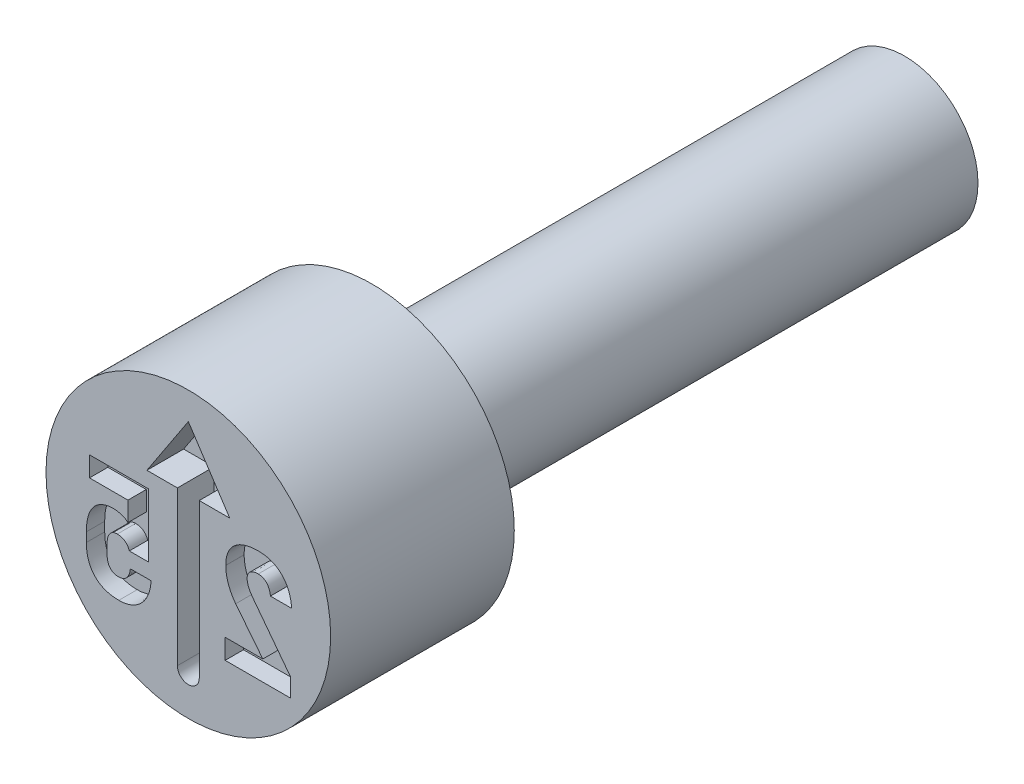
ISO-10303-21;
HEADER;
FILE_DESCRIPTION(('STEP AP214'),'2;1');
FILE_NAME('part.step','',(''),(''),'','','');
FILE_SCHEMA(('AUTOMOTIVE_DESIGN { 1 0 10303 214 1 1 1 1 }'));
ENDSEC;
DATA;
#1=APPLICATION_CONTEXT('core data for automotive mechanical design processes');
#2=APPLICATION_PROTOCOL_DEFINITION('international standard','automotive_design',2000,#1);
#3=PRODUCT_CONTEXT('',#1,'mechanical');
#4=PRODUCT('Part','Part','',(#3));
#5=PRODUCT_RELATED_PRODUCT_CATEGORY('part','',(#4));
#6=PRODUCT_DEFINITION_FORMATION('','',#4);
#7=PRODUCT_DEFINITION_CONTEXT('part definition',#1,'design');
#8=PRODUCT_DEFINITION('design','',#6,#7);
#9=PRODUCT_DEFINITION_SHAPE('','',#8);
#10=(LENGTH_UNIT() NAMED_UNIT(*) SI_UNIT(.MILLI.,.METRE.));
#11=(NAMED_UNIT(*) PLANE_ANGLE_UNIT() SI_UNIT($,.RADIAN.));
#12=(NAMED_UNIT(*) SI_UNIT($,.STERADIAN.) SOLID_ANGLE_UNIT());
#13=UNCERTAINTY_MEASURE_WITH_UNIT(LENGTH_MEASURE(1.E-05),#10,'distance_accuracy_value','');
#14=(GEOMETRIC_REPRESENTATION_CONTEXT(3) GLOBAL_UNCERTAINTY_ASSIGNED_CONTEXT((#13)) GLOBAL_UNIT_ASSIGNED_CONTEXT((#10,
#11,#12)) REPRESENTATION_CONTEXT('',''));
#15=CARTESIAN_POINT('',(0.,0.,0.));
#16=DIRECTION('',(0.,0.,1.));
#17=DIRECTION('',(1.,0.,0.));
#18=AXIS2_PLACEMENT_3D('',#15,#16,#17);
#19=CARTESIAN_POINT('',(0.,0.799999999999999,-2.));
#20=DIRECTION('',(0.,0.,1.));
#21=DIRECTION('',(1.,0.,0.));
#22=AXIS2_PLACEMENT_3D('',#19,#20,#21);
#23=PLANE('',#22);
#24=CARTESIAN_POINT('',(0.,0.,-2.));
#25=DIRECTION('',(0.,0.,1.));
#26=DIRECTION('',(1.,0.,0.));
#27=AXIS2_PLACEMENT_3D('',#24,#25,#26);
#28=CIRCLE('',#27,1.55);
#29=CARTESIAN_POINT('',(1.55,0.,-2.));
#30=VERTEX_POINT('',#29);
#31=EDGE_CURVE('E11',#30,#30,#28,.T.);
#32=ORIENTED_EDGE('',*,*,#31,.F.);
#33=EDGE_LOOP('',(#32));
#34=FACE_BOUND('',#33,.T.);
#35=CARTESIAN_POINT('',(0.,0.,-2.));
#36=DIRECTION('',(0.,0.,1.));
#37=DIRECTION('',(1.,0.,0.));
#38=AXIS2_PLACEMENT_3D('',#35,#36,#37);
#39=CIRCLE('',#38,0.799999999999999);
#40=CARTESIAN_POINT('',(0.799999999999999,0.,-2.));
#41=VERTEX_POINT('',#40);
#42=EDGE_CURVE('E562',#41,#41,#39,.T.);
#43=ORIENTED_EDGE('',*,*,#42,.T.);
#44=EDGE_LOOP('',(#43));
#45=FACE_BOUND('',#44,.T.);
#46=ADVANCED_FACE('F34',(#34,#45),#23,.F.);
#47=CARTESIAN_POINT('',(0.,0.,-0.403888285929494));
#48=DIRECTION('',(0.,0.,1.));
#49=DIRECTION('',(1.,0.,0.));
#50=AXIS2_PLACEMENT_3D('',#47,#48,#49);
#51=CYLINDRICAL_SURFACE('',#50,1.55);
#52=CARTESIAN_POINT('',(0.,0.,0.));
#53=DIRECTION('',(0.,0.,1.));
#54=DIRECTION('',(1.,0.,0.));
#55=AXIS2_PLACEMENT_3D('',#52,#53,#54);
#56=CIRCLE('',#55,1.55);
#57=CARTESIAN_POINT('',(1.55,0.,0.));
#58=VERTEX_POINT('',#57);
#59=EDGE_CURVE('E41',#58,#58,#56,.T.);
#60=ORIENTED_EDGE('',*,*,#59,.F.);
#61=EDGE_LOOP('',(#60));
#62=FACE_BOUND('',#61,.T.);
#63=ORIENTED_EDGE('',*,*,#31,.T.);
#64=EDGE_LOOP('',(#63));
#65=FACE_BOUND('',#64,.T.);
#66=ADVANCED_FACE('F584',(#62,#65),#51,.T.);
#67=CARTESIAN_POINT('',(0.,1.55,0.));
#68=DIRECTION('',(0.,0.,-1.));
#69=DIRECTION('',(-1.,0.,0.));
#70=AXIS2_PLACEMENT_3D('',#67,#68,#69);
#71=PLANE('',#70);
#72=CARTESIAN_POINT('',(-0.756829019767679,-0.812471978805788,0.));
#73=CARTESIAN_POINT('',(-0.741057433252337,-0.811990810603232,0.));
#74=CARTESIAN_POINT('',(-0.710195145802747,-0.811049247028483,0.));
#75=CARTESIAN_POINT('',(-0.665208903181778,-0.802596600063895,0.));
#76=CARTESIAN_POINT('',(-0.622560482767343,-0.789506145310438,0.));
#77=CARTESIAN_POINT('',(-0.582567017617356,-0.770831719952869,0.));
#78=CARTESIAN_POINT('',(-0.54566307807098,-0.747106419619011,0.));
#79=CARTESIAN_POINT('',(-0.512664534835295,-0.718094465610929,0.));
#80=CARTESIAN_POINT('',(-0.483268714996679,-0.68455544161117,0.));
#81=CARTESIAN_POINT('',(-0.458065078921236,-0.646195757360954,0.));
#82=CARTESIAN_POINT('',(-0.437308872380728,-0.603425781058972,0.));
#83=CARTESIAN_POINT('',(-0.42114980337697,-0.556749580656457,0.));
#84=CARTESIAN_POINT('',(-0.410051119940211,-0.506251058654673,0.));
#85=CARTESIAN_POINT('',(-0.406824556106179,-0.471216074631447,0.));
#86=CARTESIAN_POINT('',(-0.405168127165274,-0.453230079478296,0.));
#87=B_SPLINE_CURVE_WITH_KNOTS('',3,(#72,#73,#74,#75,#76,#77,#78,#79,#80,#81,#82,#83,#84,#85,
#86),.UNSPECIFIED.,.F.,.F.,(4,1,1,1,1,1,1,1,1,1,1,1,4),(0.,0.084430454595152,0.165215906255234,
0.244369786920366,0.322918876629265,0.400936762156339,0.478631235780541,0.557558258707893,
0.639203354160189,0.723781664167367,0.811629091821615,0.903295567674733,1.),.UNSPECIFIED.);
#88=CARTESIAN_POINT('',(-0.756829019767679,-0.812471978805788,0.));
#89=VERTEX_POINT('',#88);
#90=CARTESIAN_POINT('',(-0.405168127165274,-0.453230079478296,0.));
#91=VERTEX_POINT('',#90);
#92=EDGE_CURVE('E856',#89,#91,#87,.T.);
#93=ORIENTED_EDGE('',*,*,#92,.F.);
#94=CARTESIAN_POINT('',(-1.1106908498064,-0.444181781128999,0.));
#95=CARTESIAN_POINT('',(-1.11015514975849,-0.462871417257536,0.));
#96=CARTESIAN_POINT('',(-1.1091188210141,-0.49902711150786,0.));
#97=CARTESIAN_POINT('',(-1.1017079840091,-0.551310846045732,0.));
#98=CARTESIAN_POINT('',(-1.08834834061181,-0.599270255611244,0.));
#99=CARTESIAN_POINT('',(-1.07044838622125,-0.643215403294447,0.));
#100=CARTESIAN_POINT('',(-1.04707477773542,-0.68227302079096,0.));
#101=CARTESIAN_POINT('',(-1.01908626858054,-0.716773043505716,0.));
#102=CARTESIAN_POINT('',(-0.985972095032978,-0.745918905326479,0.));
#103=CARTESIAN_POINT('',(-0.948513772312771,-0.770447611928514,0.));
#104=CARTESIAN_POINT('',(-0.906354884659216,-0.789259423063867,0.));
#105=CARTESIAN_POINT('',(-0.860169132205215,-0.802925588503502,0.));
#106=CARTESIAN_POINT('',(-0.809773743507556,-0.811054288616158,0.));
#107=CARTESIAN_POINT('',(-0.774874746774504,-0.811988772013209,0.));
#108=CARTESIAN_POINT('',(-0.756829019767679,-0.812471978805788,0.));
#109=B_SPLINE_CURVE_WITH_KNOTS('',3,(#94,#95,#96,#97,#98,#99,#100,#101,#102,#103,#104,#105,#106,
#107,#108),.UNSPECIFIED.,.F.,.F.,(4,1,1,1,1,1,1,1,1,1,1,1,4),(0.,0.096591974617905,
0.1868602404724,0.272108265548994,0.35332451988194,0.431359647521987,0.506505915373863,
0.582010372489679,0.6584354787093,0.737063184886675,0.819709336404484,0.906774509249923,1.),.UNSPECIFIED.);
#110=CARTESIAN_POINT('',(-1.1106908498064,-0.444181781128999,0.));
#111=VERTEX_POINT('',#110);
#112=EDGE_CURVE('E48',#111,#89,#109,.T.);
#113=ORIENTED_EDGE('',*,*,#112,.F.);
#114=DIRECTION('',(0.,-1.,0.));
#115=VECTOR('',#114,1.);
#116=CARTESIAN_POINT('',(-1.1106908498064,-0.343672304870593,0.));
#117=LINE('',#116,#115);
#118=CARTESIAN_POINT('',(-1.1106908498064,-0.343672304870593,0.));
#119=VERTEX_POINT('',#118);
#120=EDGE_CURVE('E329',#119,#111,#117,.T.);
#121=ORIENTED_EDGE('',*,*,#120,.F.);
#122=CARTESIAN_POINT('',(-0.815276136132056,0.0236396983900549,0.));
#123=CARTESIAN_POINT('',(-0.830315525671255,0.0231635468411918,0.));
#124=CARTESIAN_POINT('',(-0.859484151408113,0.0222400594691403,0.));
#125=CARTESIAN_POINT('',(-0.901557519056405,0.013933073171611,0.));
#126=CARTESIAN_POINT('',(-0.940332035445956,0.000624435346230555,0.));
#127=CARTESIAN_POINT('',(-0.975487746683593,-0.0185494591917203,0.));
#128=CARTESIAN_POINT('',(-1.00706441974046,-0.0425810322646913,0.));
#129=CARTESIAN_POINT('',(-1.03449114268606,-0.0719456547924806,0.));
#130=CARTESIAN_POINT('',(-1.05793889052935,-0.106164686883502,0.));
#131=CARTESIAN_POINT('',(-1.0771288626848,-0.14526102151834,0.));
#132=CARTESIAN_POINT('',(-1.09223217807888,-0.188892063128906,0.));
#133=CARTESIAN_POINT('',(-1.10320216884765,-0.236753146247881,0.));
#134=CARTESIAN_POINT('',(-1.10945371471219,-0.288890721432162,0.));
#135=CARTESIAN_POINT('',(-1.11026890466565,-0.324988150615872,0.));
#136=CARTESIAN_POINT('',(-1.1106908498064,-0.343672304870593,0.));
#137=B_SPLINE_CURVE_WITH_KNOTS('',3,(#122,#123,#124,#125,#126,#127,#128,#129,#130,#131,#132,
#133,#134,#135,#136),.UNSPECIFIED.,.F.,.F.,(4,1,1,1,1,1,1,1,1,1,1,1,4),(0.,0.0843949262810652,
0.163682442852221,0.239848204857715,0.313806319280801,0.3876154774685,0.461788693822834,
0.538496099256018,0.61978489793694,0.70565234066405,0.797279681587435,0.895071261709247,1.),.UNSPECIFIED.);
#138=CARTESIAN_POINT('',(-0.815276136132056,0.0236396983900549,0.));
#139=VERTEX_POINT('',#138);
#140=EDGE_CURVE('E332',#139,#119,#137,.T.);
#141=ORIENTED_EDGE('',*,*,#140,.F.);
#142=CARTESIAN_POINT('',(-0.657786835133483,-0.0299164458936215,0.));
#143=CARTESIAN_POINT('',(-0.662339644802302,-0.0258850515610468,0.));
#144=CARTESIAN_POINT('',(-0.671705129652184,-0.0175921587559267,0.));
#145=CARTESIAN_POINT('',(-0.688078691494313,-0.00706249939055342,0.));
#146=CARTESIAN_POINT('',(-0.706805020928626,0.00188072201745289,0.));
#147=CARTESIAN_POINT('',(-0.734437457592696,0.0121808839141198,0.));
#148=CARTESIAN_POINT('',(-0.770786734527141,0.0213402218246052,0.));
#149=CARTESIAN_POINT('',(-0.800626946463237,0.0228825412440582,0.));
#150=CARTESIAN_POINT('',(-0.815276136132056,0.0236396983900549,0.));
#151=B_SPLINE_CURVE_WITH_KNOTS('',3,(#142,#143,#144,#145,#146,#147,#148,#149,#150),
.UNSPECIFIED.,.F.,.F.,(4,1,1,1,1,1,4),(0.,0.10729164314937,0.220707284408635,0.342410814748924,
0.473179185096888,0.741372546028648,1.),.UNSPECIFIED.);
#152=CARTESIAN_POINT('',(-0.657786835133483,-0.0299164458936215,0.));
#153=VERTEX_POINT('',#152);
#154=EDGE_CURVE('E783',#153,#139,#151,.T.);
#155=ORIENTED_EDGE('',*,*,#154,.F.);
#156=DIRECTION('',(0.,-1.,0.));
#157=VECTOR('',#156,1.);
#158=CARTESIAN_POINT('',(-0.657786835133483,0.182107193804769,0.));
#159=LINE('',#158,#157);
#160=CARTESIAN_POINT('',(-0.657786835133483,0.182107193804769,0.));
#161=VERTEX_POINT('',#160);
#162=EDGE_CURVE('E791',#161,#153,#159,.T.);
#163=ORIENTED_EDGE('',*,*,#162,.F.);
#164=DIRECTION('',(1.,0.,0.));
#165=VECTOR('',#164,1.);
#166=CARTESIAN_POINT('',(-1.07620949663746,0.182107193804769,0.));
#167=LINE('',#166,#165);
#168=CARTESIAN_POINT('',(-1.07620949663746,0.182107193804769,0.));
#169=VERTEX_POINT('',#168);
#170=EDGE_CURVE('E797',#169,#161,#167,.T.);
#171=ORIENTED_EDGE('',*,*,#170,.F.);
#172=DIRECTION('',(0.,-1.,0.));
#173=VECTOR('',#172,1.);
#174=CARTESIAN_POINT('',(-1.07620949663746,0.4,0.));
#175=LINE('',#174,#173);
#176=CARTESIAN_POINT('',(-1.07620949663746,0.4,0.));
#177=VERTEX_POINT('',#176);
#178=EDGE_CURVE('E800',#177,#169,#175,.T.);
#179=ORIENTED_EDGE('',*,*,#178,.F.);
#180=DIRECTION('',(-1.,0.,0.));
#181=VECTOR('',#180,1.);
#182=CARTESIAN_POINT('',(-0.43157937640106,0.4,0.));
#183=LINE('',#182,#181);
#184=CARTESIAN_POINT('',(-0.43157937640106,0.4,0.));
#185=VERTEX_POINT('',#184);
#186=EDGE_CURVE('E803',#185,#177,#183,.T.);
#187=ORIENTED_EDGE('',*,*,#186,.F.);
#188=DIRECTION('',(0.,1.,0.));
#189=VECTOR('',#188,1.);
#190=CARTESIAN_POINT('',(-0.43157937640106,-0.289871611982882,0.));
#191=LINE('',#190,#189);
#192=CARTESIAN_POINT('',(-0.43157937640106,-0.289871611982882,0.));
#193=VERTEX_POINT('',#192);
#194=EDGE_CURVE('E806',#193,#185,#191,.T.);
#195=ORIENTED_EDGE('',*,*,#194,.F.);
#196=DIRECTION('',(1.,0.,0.));
#197=VECTOR('',#196,1.);
#198=CARTESIAN_POINT('',(-0.642869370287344,-0.289871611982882,0.));
#199=LINE('',#198,#197);
#200=CARTESIAN_POINT('',(-0.642869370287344,-0.289871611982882,0.));
#201=VERTEX_POINT('',#200);
#202=EDGE_CURVE('E809',#201,#193,#199,.T.);
#203=ORIENTED_EDGE('',*,*,#202,.F.);
#204=CARTESIAN_POINT('',(-0.773213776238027,-0.195720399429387,0.));
#205=CARTESIAN_POINT('',(-0.765362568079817,-0.195959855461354,0.));
#206=CARTESIAN_POINT('',(-0.750162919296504,-0.196423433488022,0.));
#207=CARTESIAN_POINT('',(-0.728277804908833,-0.201223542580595,0.));
#208=CARTESIAN_POINT('',(-0.708163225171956,-0.209077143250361,0.));
#209=CARTESIAN_POINT('',(-0.690047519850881,-0.220180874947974,0.));
#210=CARTESIAN_POINT('',(-0.674047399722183,-0.233789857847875,0.));
#211=CARTESIAN_POINT('',(-0.660874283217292,-0.250233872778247,0.));
#212=CARTESIAN_POINT('',(-0.649831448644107,-0.268814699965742,0.));
#213=CARTESIAN_POINT('',(-0.645223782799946,-0.282750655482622,0.));
#214=CARTESIAN_POINT('',(-0.642869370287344,-0.289871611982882,0.));
#215=B_SPLINE_CURVE_WITH_KNOTS('',3,(#204,#205,#206,#207,#208,#209,#210,#211,#212,#213,#214),
.UNSPECIFIED.,.F.,.F.,(4,1,1,1,1,1,1,1,4),(0.,0.135635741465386,0.262585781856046,
0.38539589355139,0.507524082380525,0.628507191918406,0.746772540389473,0.870606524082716,1.),.UNSPECIFIED.);
#216=CARTESIAN_POINT('',(-0.773213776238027,-0.195720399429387,0.));
#217=VERTEX_POINT('',#216);
#218=EDGE_CURVE('E812',#217,#201,#215,.T.);
#219=ORIENTED_EDGE('',*,*,#218,.F.);
#220=CARTESIAN_POINT('',(-0.884727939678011,-0.343672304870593,0.));
#221=CARTESIAN_POINT('',(-0.884486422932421,-0.332474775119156,0.));
#222=CARTESIAN_POINT('',(-0.884028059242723,-0.311223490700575,0.));
#223=CARTESIAN_POINT('',(-0.878326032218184,-0.281496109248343,0.));
#224=CARTESIAN_POINT('',(-0.869460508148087,-0.255559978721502,0.));
#225=CARTESIAN_POINT('',(-0.856367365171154,-0.234029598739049,0.));
#226=CARTESIAN_POINT('',(-0.840091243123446,-0.216651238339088,0.));
#227=CARTESIAN_POINT('',(-0.820395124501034,-0.204308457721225,0.));
#228=CARTESIAN_POINT('',(-0.797674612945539,-0.197018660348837,0.));
#229=CARTESIAN_POINT('',(-0.781583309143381,-0.196164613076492,0.));
#230=CARTESIAN_POINT('',(-0.773213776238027,-0.195720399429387,0.));
#231=B_SPLINE_CURVE_WITH_KNOTS('',3,(#220,#221,#222,#223,#224,#225,#226,#227,#228,#229,#230),
.UNSPECIFIED.,.F.,.F.,(4,1,1,1,1,1,1,1,4),(0.,0.160198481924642,0.304033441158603,
0.431843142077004,0.550810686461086,0.662316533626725,0.76988812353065,0.88031243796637,1.),.UNSPECIFIED.);
#232=CARTESIAN_POINT('',(-0.884727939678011,-0.343672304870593,0.));
#233=VERTEX_POINT('',#232);
#234=EDGE_CURVE('E817',#233,#217,#231,.T.);
#235=ORIENTED_EDGE('',*,*,#234,.F.);
#236=DIRECTION('',(0.,1.,0.));
#237=VECTOR('',#236,1.);
#238=CARTESIAN_POINT('',(-0.884727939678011,-0.444181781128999,0.));
#239=LINE('',#238,#237);
#240=CARTESIAN_POINT('',(-0.884727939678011,-0.444181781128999,0.));
#241=VERTEX_POINT('',#240);
#242=EDGE_CURVE('E825',#241,#233,#239,.T.);
#243=ORIENTED_EDGE('',*,*,#242,.F.);
#244=CARTESIAN_POINT('',(-0.760008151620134,-0.592867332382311,0.));
#245=CARTESIAN_POINT('',(-0.769439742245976,-0.592456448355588,0.));
#246=CARTESIAN_POINT('',(-0.787479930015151,-0.59167053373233,0.));
#247=CARTESIAN_POINT('',(-0.812766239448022,-0.584085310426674,0.));
#248=CARTESIAN_POINT('',(-0.834778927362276,-0.571941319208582,0.));
#249=CARTESIAN_POINT('',(-0.85296144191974,-0.554466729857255,0.));
#250=CARTESIAN_POINT('',(-0.867466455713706,-0.532693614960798,0.));
#251=CARTESIAN_POINT('',(-0.87773393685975,-0.506620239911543,0.));
#252=CARTESIAN_POINT('',(-0.883814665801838,-0.476660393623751,0.));
#253=CARTESIAN_POINT('',(-0.884413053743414,-0.455380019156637,0.));
#254=CARTESIAN_POINT('',(-0.884727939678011,-0.444181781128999,0.));
#255=B_SPLINE_CURVE_WITH_KNOTS('',3,(#244,#245,#246,#247,#248,#249,#250,#251,#252,#253,#254),
.UNSPECIFIED.,.F.,.F.,(4,1,1,1,1,1,1,1,4),(0.,0.128261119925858,0.245330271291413,
0.356275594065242,0.467886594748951,0.585607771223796,0.710231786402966,0.847517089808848,1.),.UNSPECIFIED.);
#256=CARTESIAN_POINT('',(-0.760008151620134,-0.592867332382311,0.));
#257=VERTEX_POINT('',#256);
#258=EDGE_CURVE('E831',#257,#241,#255,.T.);
#259=ORIENTED_EDGE('',*,*,#258,.F.);
#260=CARTESIAN_POINT('',(-0.631375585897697,-0.453230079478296,0.));
#261=CARTESIAN_POINT('',(-0.632666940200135,-0.463733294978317,0.));
#262=CARTESIAN_POINT('',(-0.635127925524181,-0.483749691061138,0.));
#263=CARTESIAN_POINT('',(-0.644002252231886,-0.511526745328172,0.));
#264=CARTESIAN_POINT('',(-0.655588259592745,-0.535942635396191,0.));
#265=CARTESIAN_POINT('',(-0.670892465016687,-0.556429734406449,0.));
#266=CARTESIAN_POINT('',(-0.689066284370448,-0.573062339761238,0.));
#267=CARTESIAN_POINT('',(-0.71060165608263,-0.584342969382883,0.));
#268=CARTESIAN_POINT('',(-0.734402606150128,-0.591870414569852,0.));
#269=CARTESIAN_POINT('',(-0.751306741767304,-0.592528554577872,0.));
#270=CARTESIAN_POINT('',(-0.760008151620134,-0.592867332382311,0.));
#271=B_SPLINE_CURVE_WITH_KNOTS('',3,(#260,#261,#262,#263,#264,#265,#266,#267,#268,#269,#270),
.UNSPECIFIED.,.F.,.F.,(4,1,1,1,1,1,1,1,4),(0.,0.150277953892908,0.286390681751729,
0.412971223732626,0.533144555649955,0.648163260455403,0.760273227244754,0.876600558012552,1.),.UNSPECIFIED.);
#272=CARTESIAN_POINT('',(-0.631375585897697,-0.453230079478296,0.));
#273=VERTEX_POINT('',#272);
#274=EDGE_CURVE('E836',#273,#257,#271,.T.);
#275=ORIENTED_EDGE('',*,*,#274,.F.);
#276=DIRECTION('',(0.,-1.,0.));
#277=VECTOR('',#276,1.);
#278=CARTESIAN_POINT('',(-0.631375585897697,-0.452496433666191,0.));
#279=LINE('',#278,#277);
#280=CARTESIAN_POINT('',(-0.631375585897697,-0.452496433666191,0.));
#281=VERTEX_POINT('',#280);
#282=EDGE_CURVE('E844',#281,#273,#279,.T.);
#283=ORIENTED_EDGE('',*,*,#282,.F.);
#284=DIRECTION('',(-1.,0.,0.));
#285=VECTOR('',#284,1.);
#286=CARTESIAN_POINT('',(-0.405168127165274,-0.452496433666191,0.));
#287=LINE('',#286,#285);
#288=CARTESIAN_POINT('',(-0.405168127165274,-0.452496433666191,0.));
#289=VERTEX_POINT('',#288);
#290=EDGE_CURVE('E850',#289,#281,#287,.T.);
#291=ORIENTED_EDGE('',*,*,#290,.F.);
#292=DIRECTION('',(0.,1.,0.));
#293=VECTOR('',#292,1.);
#294=CARTESIAN_POINT('',(-0.405168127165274,-0.453230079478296,0.));
#295=LINE('',#294,#293);
#296=EDGE_CURVE('E853',#91,#289,#295,.T.);
#297=ORIENTED_EDGE('',*,*,#296,.F.);
#298=EDGE_LOOP('',(#93,#113,#121,#141,#155,#163,#171,#179,#187,#195,#203,#219,#235,#243,#259,
#275,#283,#291,#297));
#299=FACE_BOUND('',#298,.T.);
#300=DIRECTION('',(-0.60539313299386,0.795926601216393,0.));
#301=VECTOR('',#300,1.);
#302=CARTESIAN_POINT('',(1.11073975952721,-0.596046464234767,0.));
#303=LINE('',#302,#301);
#304=CARTESIAN_POINT('',(1.11073975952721,-0.596046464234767,0.));
#305=VERTEX_POINT('',#304);
#306=CARTESIAN_POINT('',(0.698919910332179,-0.0546158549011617,0.));
#307=VERTEX_POINT('',#306);
#308=EDGE_CURVE('E405',#305,#307,#303,.T.);
#309=ORIENTED_EDGE('',*,*,#308,.F.);
#310=DIRECTION('',(0.,1.,0.));
#311=VECTOR('',#310,1.);
#312=CARTESIAN_POINT('',(1.11073975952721,-0.8,0.));
#313=LINE('',#312,#311);
#314=CARTESIAN_POINT('',(1.11073975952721,-0.8,0.));
#315=VERTEX_POINT('',#314);
#316=EDGE_CURVE('E56',#315,#305,#313,.T.);
#317=ORIENTED_EDGE('',*,*,#316,.F.);
#318=DIRECTION('',(1.,0.,0.));
#319=VECTOR('',#318,1.);
#320=CARTESIAN_POINT('',(0.401059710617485,-0.8,0.));
#321=LINE('',#320,#319);
#322=CARTESIAN_POINT('',(0.401059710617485,-0.8,0.));
#323=VERTEX_POINT('',#322);
#324=EDGE_CURVE('E481',#323,#315,#321,.T.);
#325=ORIENTED_EDGE('',*,*,#324,.F.);
#326=DIRECTION('',(0.,-1.,0.));
#327=VECTOR('',#326,1.);
#328=CARTESIAN_POINT('',(0.401059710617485,-0.582107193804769,0.));
#329=LINE('',#328,#327);
#330=CARTESIAN_POINT('',(0.401059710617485,-0.582107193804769,0.));
#331=VERTEX_POINT('',#330);
#332=EDGE_CURVE('E478',#331,#323,#329,.T.);
#333=ORIENTED_EDGE('',*,*,#332,.F.);
#334=DIRECTION('',(-1.,0.,0.));
#335=VECTOR('',#334,1.);
#336=CARTESIAN_POINT('',(0.811167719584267,-0.582107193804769,0.));
#337=LINE('',#336,#335);
#338=CARTESIAN_POINT('',(0.811167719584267,-0.582107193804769,0.));
#339=VERTEX_POINT('',#338);
#340=EDGE_CURVE('E475',#339,#331,#337,.T.);
#341=ORIENTED_EDGE('',*,*,#340,.F.);
#342=DIRECTION('',(0.620676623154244,-0.78406666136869,0.));
#343=VECTOR('',#342,1.);
#344=CARTESIAN_POINT('',(0.515753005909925,-0.208926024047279,0.));
#345=LINE('',#344,#343);
#346=CARTESIAN_POINT('',(0.515753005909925,-0.20892602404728,0.));
#347=VERTEX_POINT('',#346);
#348=EDGE_CURVE('E469',#347,#339,#345,.T.);
#349=ORIENTED_EDGE('',*,*,#348,.F.);
#350=CARTESIAN_POINT('',(0.407662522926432,0.0987161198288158,0.));
#351=CARTESIAN_POINT('',(0.407976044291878,0.0850857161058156,0.));
#352=CARTESIAN_POINT('',(0.408603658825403,0.0578000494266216,0.));
#353=CARTESIAN_POINT('',(0.414201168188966,0.0170361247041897,0.));
#354=CARTESIAN_POINT('',(0.423353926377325,-0.0234922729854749,0.));
#355=CARTESIAN_POINT('',(0.435772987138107,-0.063643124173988,0.));
#356=CARTESIAN_POINT('',(0.451280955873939,-0.10274599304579,0.));
#357=CARTESIAN_POINT('',(0.469788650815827,-0.140177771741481,0.));
#358=CARTESIAN_POINT('',(0.490918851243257,-0.175842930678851,0.));
#359=CARTESIAN_POINT('',(0.507476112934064,-0.197899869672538,0.));
#360=CARTESIAN_POINT('',(0.515753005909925,-0.20892602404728,0.));
#361=B_SPLINE_CURVE_WITH_KNOTS('',3,(#350,#351,#352,#353,#354,#355,#356,#357,#358,#359,#360),
.UNSPECIFIED.,.F.,.F.,(4,1,1,1,1,1,1,1,4),(0.,0.123148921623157,0.246522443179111,
0.371108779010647,0.498350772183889,0.625999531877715,0.750879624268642,0.875465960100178,1.),.UNSPECIFIED.);
#362=CARTESIAN_POINT('',(0.407662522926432,0.0987161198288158,0.));
#363=VERTEX_POINT('',#362);
#364=EDGE_CURVE('E464',#363,#347,#361,.T.);
#365=ORIENTED_EDGE('',*,*,#364,.F.);
#366=DIRECTION('',(0.,-1.,0.));
#367=VECTOR('',#366,1.);
#368=CARTESIAN_POINT('',(0.407662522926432,0.099694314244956,0.));
#369=LINE('',#368,#367);
#370=CARTESIAN_POINT('',(0.407662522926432,0.099694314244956,0.));
#371=VERTEX_POINT('',#370);
#372=EDGE_CURVE('E458',#371,#363,#369,.T.);
#373=ORIENTED_EDGE('',*,*,#372,.F.);
#374=CARTESIAN_POINT('',(0.762502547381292,0.412471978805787,0.));
#375=CARTESIAN_POINT('',(0.744465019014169,0.412094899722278,0.));
#376=CARTESIAN_POINT('',(0.709554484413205,0.411365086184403,0.));
#377=CARTESIAN_POINT('',(0.6592856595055,0.404494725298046,0.));
#378=CARTESIAN_POINT('',(0.613062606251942,0.393061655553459,0.));
#379=CARTESIAN_POINT('',(0.571001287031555,0.376998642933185,0.));
#380=CARTESIAN_POINT('',(0.533377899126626,0.356350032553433,0.));
#381=CARTESIAN_POINT('',(0.500018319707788,0.331840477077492,0.));
#382=CARTESIAN_POINT('',(0.471864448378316,0.302518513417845,0.));
#383=CARTESIAN_POINT('',(0.448445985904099,0.269208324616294,0.));
#384=CARTESIAN_POINT('',(0.429985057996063,0.232038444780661,0.));
#385=CARTESIAN_POINT('',(0.41705693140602,0.191040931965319,0.));
#386=CARTESIAN_POINT('',(0.409139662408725,0.146545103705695,0.));
#387=CARTESIAN_POINT('',(0.408164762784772,0.115623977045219,0.));
#388=CARTESIAN_POINT('',(0.407662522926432,0.099694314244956,0.));
#389=B_SPLINE_CURVE_WITH_KNOTS('',3,(#374,#375,#376,#377,#378,#379,#380,#381,#382,#383,#384,
#385,#386,#387,#388),.UNSPECIFIED.,.F.,.F.,(4,1,1,1,1,1,1,1,1,1,1,1,4),(0.,0.100715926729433,
0.194929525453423,0.2827284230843,0.366191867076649,0.44566981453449,0.521804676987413,
0.596515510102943,0.671682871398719,0.748455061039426,0.827368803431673,0.911065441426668,1.),.UNSPECIFIED.);
#390=CARTESIAN_POINT('',(0.762502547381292,0.412471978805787,0.));
#391=VERTEX_POINT('',#390);
#392=EDGE_CURVE('E450',#391,#371,#389,.T.);
#393=ORIENTED_EDGE('',*,*,#392,.F.);
#394=CARTESIAN_POINT('',(1.12565722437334,0.0534746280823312,0.));
#395=CARTESIAN_POINT('',(1.12399612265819,0.0715403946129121,0.));
#396=CARTESIAN_POINT('',(1.12076019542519,0.10673360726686,0.));
#397=CARTESIAN_POINT('',(1.10975712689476,0.15734426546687,0.));
#398=CARTESIAN_POINT('',(1.09350240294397,0.203913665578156,0.));
#399=CARTESIAN_POINT('',(1.07273473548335,0.246570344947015,0.));
#400=CARTESIAN_POINT('',(1.04726995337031,0.284775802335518,0.));
#401=CARTESIAN_POINT('',(1.01772322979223,0.318519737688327,0.));
#402=CARTESIAN_POINT('',(0.983767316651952,0.347146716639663,0.));
#403=CARTESIAN_POINT('',(0.945990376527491,0.370934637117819,0.));
#404=CARTESIAN_POINT('',(0.904557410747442,0.389551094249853,0.));
#405=CARTESIAN_POINT('',(0.859975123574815,0.403115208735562,0.));
#406=CARTESIAN_POINT('',(0.812176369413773,0.410934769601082,0.));
#407=CARTESIAN_POINT('',(0.779323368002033,0.41195144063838,0.));
#408=CARTESIAN_POINT('',(0.762502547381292,0.412471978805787,0.));
#409=B_SPLINE_CURVE_WITH_KNOTS('',3,(#394,#395,#396,#397,#398,#399,#400,#401,#402,#403,#404,
#405,#406,#407,#408),.UNSPECIFIED.,.F.,.F.,(4,1,1,1,1,1,1,1,1,1,1,1,4),(0.,0.0953291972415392,
0.185707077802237,0.271513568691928,0.354131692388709,0.434493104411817,0.512233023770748,
0.58917600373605,0.667186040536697,0.746219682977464,0.827302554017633,0.911578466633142,1.),.UNSPECIFIED.);
#410=CARTESIAN_POINT('',(1.12565722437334,0.0534746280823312,0.));
#411=VERTEX_POINT('',#410);
#412=EDGE_CURVE('E445',#411,#391,#409,.T.);
#413=ORIENTED_EDGE('',*,*,#412,.F.);
#414=DIRECTION('',(0.,1.,0.));
#415=VECTOR('',#414,1.);
#416=CARTESIAN_POINT('',(1.12565722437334,0.052496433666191,0.));
#417=LINE('',#416,#415);
#418=CARTESIAN_POINT('',(1.12565722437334,0.052496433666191,0.));
#419=VERTEX_POINT('',#418);
#420=EDGE_CURVE('E442',#419,#411,#417,.T.);
#421=ORIENTED_EDGE('',*,*,#420,.F.);
#422=DIRECTION('',(1.,0.,0.));
#423=VECTOR('',#422,1.);
#424=CARTESIAN_POINT('',(0.893825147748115,0.052496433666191,0.));
#425=LINE('',#424,#423);
#426=CARTESIAN_POINT('',(0.893825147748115,0.052496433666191,0.));
#427=VERTEX_POINT('',#426);
#428=EDGE_CURVE('E439',#427,#419,#425,.T.);
#429=ORIENTED_EDGE('',*,*,#428,.F.);
#430=DIRECTION('',(0.,-1.,0.));
#431=VECTOR('',#430,1.);
#432=CARTESIAN_POINT('',(0.893825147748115,0.0534746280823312,0.));
#433=LINE('',#432,#431);
#434=CARTESIAN_POINT('',(0.893825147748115,0.0534746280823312,0.));
#435=VERTEX_POINT('',#434);
#436=EDGE_CURVE('E433',#435,#427,#433,.T.);
#437=ORIENTED_EDGE('',*,*,#436,.F.);
#438=CARTESIAN_POINT('',(0.760790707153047,0.194579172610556,0.));
#439=CARTESIAN_POINT('',(0.769721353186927,0.194201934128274,0.));
#440=CARTESIAN_POINT('',(0.787052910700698,0.193469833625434,0.));
#441=CARTESIAN_POINT('',(0.811707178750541,0.186493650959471,0.));
#442=CARTESIAN_POINT('',(0.83360840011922,0.174650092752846,0.));
#443=CARTESIAN_POINT('',(0.852567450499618,0.158282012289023,0.));
#444=CARTESIAN_POINT('',(0.868475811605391,0.137690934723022,0.));
#445=CARTESIAN_POINT('',(0.880201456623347,0.112885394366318,0.));
#446=CARTESIAN_POINT('',(0.889644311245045,0.0846928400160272,0.));
#447=CARTESIAN_POINT('',(0.892384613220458,0.0642310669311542,0.));
#448=CARTESIAN_POINT('',(0.893825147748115,0.0534746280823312,0.));
#449=B_SPLINE_CURVE_WITH_KNOTS('',3,(#438,#439,#440,#441,#442,#443,#444,#445,#446,#447,#448),
.UNSPECIFIED.,.F.,.F.,(4,1,1,1,1,1,1,1,4),(0.,0.124212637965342,0.241057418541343,
0.353359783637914,0.468536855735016,0.587568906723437,0.713021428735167,0.849139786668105,1.),.UNSPECIFIED.);
#450=CARTESIAN_POINT('',(0.760790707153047,0.194579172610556,0.));
#451=VERTEX_POINT('',#450);
#452=EDGE_CURVE('E425',#451,#435,#449,.T.);
#453=ORIENTED_EDGE('',*,*,#452,.F.);
#454=CARTESIAN_POINT('',(0.640472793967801,0.0930915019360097,0.));
#455=CARTESIAN_POINT('',(0.64080098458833,0.100797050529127,0.));
#456=CARTESIAN_POINT('',(0.641426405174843,0.115481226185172,0.));
#457=CARTESIAN_POINT('',(0.647464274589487,0.136140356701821,0.));
#458=CARTESIAN_POINT('',(0.657448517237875,0.154004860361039,0.));
#459=CARTESIAN_POINT('',(0.671433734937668,0.168980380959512,0.));
#460=CARTESIAN_POINT('',(0.689223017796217,0.180489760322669,0.));
#461=CARTESIAN_POINT('',(0.710206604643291,0.188897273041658,0.));
#462=CARTESIAN_POINT('',(0.734496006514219,0.193654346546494,0.));
#463=CARTESIAN_POINT('',(0.751721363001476,0.194260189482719,0.));
#464=CARTESIAN_POINT('',(0.760790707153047,0.194579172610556,0.));
#465=B_SPLINE_CURVE_WITH_KNOTS('',3,(#454,#455,#456,#457,#458,#459,#460,#461,#462,#463,#464),
.UNSPECIFIED.,.F.,.F.,(4,1,1,1,1,1,1,1,4),(0.,0.129170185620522,0.246154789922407,
0.357734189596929,0.470108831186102,0.586692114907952,0.710769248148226,0.847716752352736,1.),.UNSPECIFIED.);
#466=CARTESIAN_POINT('',(0.640472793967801,0.0930915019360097,0.));
#467=VERTEX_POINT('',#466);
#468=EDGE_CURVE('E420',#467,#451,#465,.T.);
#469=ORIENTED_EDGE('',*,*,#468,.F.);
#470=DIRECTION('',(0.,1.,0.));
#471=VECTOR('',#470,1.);
#472=CARTESIAN_POINT('',(0.640472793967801,0.0913796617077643,0.));
#473=LINE('',#472,#471);
#474=CARTESIAN_POINT('',(0.640472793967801,0.0913796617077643,0.));
#475=VERTEX_POINT('',#474);
#476=EDGE_CURVE('E414',#475,#467,#473,.T.);
#477=ORIENTED_EDGE('',*,*,#476,.F.);
#478=CARTESIAN_POINT('',(0.698919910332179,-0.0546158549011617,0.));
#479=CARTESIAN_POINT('',(0.690282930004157,-0.0426328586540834,0.));
#480=CARTESIAN_POINT('',(0.673421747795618,-0.0192395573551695,0.));
#481=CARTESIAN_POINT('',(0.658336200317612,0.0130263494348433,0.));
#482=CARTESIAN_POINT('',(0.648752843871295,0.0383261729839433,0.));
#483=CARTESIAN_POINT('',(0.644322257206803,0.0566782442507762,0.));
#484=CARTESIAN_POINT('',(0.641042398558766,0.0742269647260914,0.));
#485=CARTESIAN_POINT('',(0.64066005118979,0.0857407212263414,0.));
#486=CARTESIAN_POINT('',(0.640472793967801,0.0913796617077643,0.));
#487=B_SPLINE_CURVE_WITH_KNOTS('',3,(#478,#479,#480,#481,#482,#483,#484,#485,#486),
.UNSPECIFIED.,.F.,.F.,(4,1,1,1,1,1,4),(0.,0.276737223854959,0.540248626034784,0.66563356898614,
0.784034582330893,0.894229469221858,1.),.UNSPECIFIED.);
#488=EDGE_CURVE('E409',#307,#475,#487,.T.);
#489=ORIENTED_EDGE('',*,*,#488,.F.);
#490=EDGE_LOOP('',(#309,#317,#325,#333,#341,#349,#365,#373,#393,#413,#421,#429,#437,#453,#469,
#477,#489));
#491=FACE_BOUND('',#490,.T.);
#492=DIRECTION('',(0.,1.,0.));
#493=VECTOR('',#492,1.);
#494=CARTESIAN_POINT('',(0.119045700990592,0.566469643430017,0.));
#495=LINE('',#494,#493);
#496=CARTESIAN_POINT('',(0.119045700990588,-1.11010114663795,0.));
#497=VERTEX_POINT('',#496);
#498=CARTESIAN_POINT('',(0.119045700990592,0.566469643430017,0.));
#499=VERTEX_POINT('',#498);
#500=EDGE_CURVE('E543',#497,#499,#495,.T.);
#501=ORIENTED_EDGE('',*,*,#500,.F.);
#502=CARTESIAN_POINT('',(1.02140308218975E-13,-1.11010114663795,0.));
#503=DIRECTION('',(0.,0.,1.));
#504=DIRECTION('',(1.,0.,0.));
#505=AXIS2_PLACEMENT_3D('',#502,#503,#504);
#506=CIRCLE('',#505,0.119045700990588);
#507=CARTESIAN_POINT('',(-0.119045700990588,-1.11010114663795,0.));
#508=VERTEX_POINT('',#507);
#509=EDGE_CURVE('E487',#508,#497,#506,.T.);
#510=ORIENTED_EDGE('',*,*,#509,.F.);
#511=DIRECTION('',(0.,-1.,0.));
#512=VECTOR('',#511,1.);
#513=CARTESIAN_POINT('',(-0.119045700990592,0.566469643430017,0.));
#514=LINE('',#513,#512);
#515=CARTESIAN_POINT('',(-0.119045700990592,0.566469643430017,0.));
#516=VERTEX_POINT('',#515);
#517=EDGE_CURVE('E523',#516,#508,#514,.T.);
#518=ORIENTED_EDGE('',*,*,#517,.F.);
#519=DIRECTION('',(1.,0.,0.));
#520=VECTOR('',#519,1.);
#521=CARTESIAN_POINT('',(-0.451198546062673,0.566469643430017,0.));
#522=LINE('',#521,#520);
#523=CARTESIAN_POINT('',(-0.451198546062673,0.566469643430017,0.));
#524=VERTEX_POINT('',#523);
#525=EDGE_CURVE('E555',#524,#516,#522,.T.);
#526=ORIENTED_EDGE('',*,*,#525,.F.);
#527=DIRECTION('',(-0.550159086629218,-0.835059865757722,0.));
#528=VECTOR('',#527,1.);
#529=CARTESIAN_POINT('',(0.,1.25132209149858,0.));
#530=LINE('',#529,#528);
#531=CARTESIAN_POINT('',(0.,1.25132209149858,0.));
#532=VERTEX_POINT('',#531);
#533=EDGE_CURVE('E552',#532,#524,#530,.T.);
#534=ORIENTED_EDGE('',*,*,#533,.F.);
#535=DIRECTION('',(-0.550159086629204,0.835059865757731,0.));
#536=VECTOR('',#535,1.);
#537=CARTESIAN_POINT('',(0.,1.25132209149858,0.));
#538=LINE('',#537,#536);
#539=CARTESIAN_POINT('',(0.451198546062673,0.566469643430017,0.));
#540=VERTEX_POINT('',#539);
#541=EDGE_CURVE('E549',#540,#532,#538,.T.);
#542=ORIENTED_EDGE('',*,*,#541,.F.);
#543=DIRECTION('',(1.,0.,0.));
#544=VECTOR('',#543,1.);
#545=CARTESIAN_POINT('',(0.451198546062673,0.566469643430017,0.));
#546=LINE('',#545,#544);
#547=EDGE_CURVE('E546',#499,#540,#546,.T.);
#548=ORIENTED_EDGE('',*,*,#547,.F.);
#549=EDGE_LOOP('',(#501,#510,#518,#526,#534,#542,#548));
#550=FACE_BOUND('',#549,.T.);
#551=ORIENTED_EDGE('',*,*,#59,.T.);
#552=EDGE_LOOP('',(#551));
#553=FACE_BOUND('',#552,.T.);
#554=ADVANCED_FACE('F582',(#299,#491,#550,#553),#71,.F.);
#555=CARTESIAN_POINT('',(0.,0.,-7.8));
#556=DIRECTION('',(0.,0.,1.));
#557=DIRECTION('',(1.,0.,0.));
#558=AXIS2_PLACEMENT_3D('',#555,#556,#557);
#559=PLANE('',#558);
#560=CARTESIAN_POINT('',(0.,0.,-7.8));
#561=DIRECTION('',(0.,0.,1.));
#562=DIRECTION('',(1.,0.,0.));
#563=AXIS2_PLACEMENT_3D('',#560,#561,#562);
#564=CIRCLE('',#563,0.799999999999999);
#565=CARTESIAN_POINT('',(0.799999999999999,0.,-7.8));
#566=VERTEX_POINT('',#565);
#567=EDGE_CURVE('E577',#566,#566,#564,.T.);
#568=ORIENTED_EDGE('',*,*,#567,.F.);
#569=EDGE_LOOP('',(#568));
#570=FACE_BOUND('',#569,.T.);
#571=ADVANCED_FACE('F597',(#570),#559,.F.);
#572=CARTESIAN_POINT('',(0.,0.,-0.403888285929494));
#573=DIRECTION('',(0.,0.,1.));
#574=DIRECTION('',(1.,0.,0.));
#575=AXIS2_PLACEMENT_3D('',#572,#573,#574);
#576=CYLINDRICAL_SURFACE('',#575,0.799999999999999);
#577=ORIENTED_EDGE('',*,*,#42,.F.);
#578=EDGE_LOOP('',(#577));
#579=FACE_BOUND('',#578,.T.);
#580=ORIENTED_EDGE('',*,*,#567,.T.);
#581=EDGE_LOOP('',(#580));
#582=FACE_BOUND('',#581,.T.);
#583=ADVANCED_FACE('F593',(#579,#582),#576,.T.);
#584=CARTESIAN_POINT('',(1.02140308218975E-13,-1.11010114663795,-0.4));
#585=DIRECTION('',(0.,0.,1.));
#586=DIRECTION('',(1.,0.,0.));
#587=AXIS2_PLACEMENT_3D('',#584,#585,#586);
#588=CYLINDRICAL_SURFACE('',#587,0.119045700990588);
#589=ORIENTED_EDGE('',*,*,#509,.T.);
#590=DIRECTION('',(0.,0.,1.));
#591=VECTOR('',#590,1.);
#592=CARTESIAN_POINT('',(0.119045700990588,-1.11010114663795,-0.4));
#593=LINE('',#592,#591);
#594=CARTESIAN_POINT('',(0.119045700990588,-1.11010114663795,-0.4));
#595=VERTEX_POINT('',#594);
#596=EDGE_CURVE('E541',#595,#497,#593,.T.);
#597=ORIENTED_EDGE('',*,*,#596,.F.);
#598=CARTESIAN_POINT('',(1.02140308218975E-13,-1.11010114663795,-0.4));
#599=DIRECTION('',(0.,0.,1.));
#600=DIRECTION('',(1.,0.,0.));
#601=AXIS2_PLACEMENT_3D('',#598,#599,#600);
#602=CIRCLE('',#601,0.119045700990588);
#603=CARTESIAN_POINT('',(-0.119045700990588,-1.11010114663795,-0.4));
#604=VERTEX_POINT('',#603);
#605=EDGE_CURVE('E519',#604,#595,#602,.T.);
#606=ORIENTED_EDGE('',*,*,#605,.F.);
#607=DIRECTION('',(0.,0.,1.));
#608=VECTOR('',#607,1.);
#609=CARTESIAN_POINT('',(-0.119045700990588,-1.11010114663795,-0.4));
#610=LINE('',#609,#608);
#611=EDGE_CURVE('E560',#604,#508,#610,.T.);
#612=ORIENTED_EDGE('',*,*,#611,.T.);
#613=EDGE_LOOP('',(#589,#597,#606,#612));
#614=FACE_BOUND('',#613,.T.);
#615=ADVANCED_FACE('F596',(#614),#588,.F.);
#616=CARTESIAN_POINT('',(-0.119045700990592,0.566469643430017,-0.4));
#617=DIRECTION('',(-1.,0.,0.));
#618=DIRECTION('',(0.,-1.,0.));
#619=AXIS2_PLACEMENT_3D('',#616,#617,#618);
#620=PLANE('',#619);
#621=ORIENTED_EDGE('',*,*,#517,.T.);
#622=ORIENTED_EDGE('',*,*,#611,.F.);
#623=DIRECTION('',(0.,-1.,0.));
#624=VECTOR('',#623,1.);
#625=CARTESIAN_POINT('',(-0.119045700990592,0.566469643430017,-0.4));
#626=LINE('',#625,#624);
#627=CARTESIAN_POINT('',(-0.119045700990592,0.566469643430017,-0.4));
#628=VERTEX_POINT('',#627);
#629=EDGE_CURVE('E538',#628,#604,#626,.T.);
#630=ORIENTED_EDGE('',*,*,#629,.F.);
#631=DIRECTION('',(0.,0.,1.));
#632=VECTOR('',#631,1.);
#633=CARTESIAN_POINT('',(-0.119045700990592,0.566469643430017,-0.4));
#634=LINE('',#633,#632);
#635=EDGE_CURVE('E563',#628,#516,#634,.T.);
#636=ORIENTED_EDGE('',*,*,#635,.T.);
#637=EDGE_LOOP('',(#621,#622,#630,#636));
#638=FACE_BOUND('',#637,.T.);
#639=ADVANCED_FACE('F611',(#638),#620,.F.);
#640=CARTESIAN_POINT('',(-0.451198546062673,0.566469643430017,-0.4));
#641=DIRECTION('',(0.,-1.,0.));
#642=DIRECTION('',(0.,0.,-1.));
#643=AXIS2_PLACEMENT_3D('',#640,#641,#642);
#644=PLANE('',#643);
#645=ORIENTED_EDGE('',*,*,#525,.T.);
#646=ORIENTED_EDGE('',*,*,#635,.F.);
#647=DIRECTION('',(1.,0.,0.));
#648=VECTOR('',#647,1.);
#649=CARTESIAN_POINT('',(-0.451198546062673,0.566469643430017,-0.4));
#650=LINE('',#649,#648);
#651=CARTESIAN_POINT('',(-0.451198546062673,0.566469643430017,-0.4));
#652=VERTEX_POINT('',#651);
#653=EDGE_CURVE('E535',#652,#628,#650,.T.);
#654=ORIENTED_EDGE('',*,*,#653,.F.);
#655=DIRECTION('',(0.,0.,1.));
#656=VECTOR('',#655,1.);
#657=CARTESIAN_POINT('',(-0.451198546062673,0.566469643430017,-0.4));
#658=LINE('',#657,#656);
#659=EDGE_CURVE('E565',#652,#524,#658,.T.);
#660=ORIENTED_EDGE('',*,*,#659,.T.);
#661=EDGE_LOOP('',(#645,#646,#654,#660));
#662=FACE_BOUND('',#661,.T.);
#663=ADVANCED_FACE('F629',(#662),#644,.F.);
#664=CARTESIAN_POINT('',(0.,1.25132209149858,-0.4));
#665=DIRECTION('',(-0.835059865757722,0.550159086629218,0.));
#666=DIRECTION('',(-0.550159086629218,-0.835059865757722,0.));
#667=AXIS2_PLACEMENT_3D('',#664,#665,#666);
#668=PLANE('',#667);
#669=ORIENTED_EDGE('',*,*,#533,.T.);
#670=ORIENTED_EDGE('',*,*,#659,.F.);
#671=DIRECTION('',(-0.550159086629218,-0.835059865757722,0.));
#672=VECTOR('',#671,1.);
#673=CARTESIAN_POINT('',(0.,1.25132209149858,-0.4));
#674=LINE('',#673,#672);
#675=CARTESIAN_POINT('',(0.,1.25132209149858,-0.4));
#676=VERTEX_POINT('',#675);
#677=EDGE_CURVE('E532',#676,#652,#674,.T.);
#678=ORIENTED_EDGE('',*,*,#677,.F.);
#679=DIRECTION('',(0.,0.,1.));
#680=VECTOR('',#679,1.);
#681=CARTESIAN_POINT('',(0.,1.25132209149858,-0.4));
#682=LINE('',#681,#680);
#683=EDGE_CURVE('E567',#676,#532,#682,.T.);
#684=ORIENTED_EDGE('',*,*,#683,.T.);
#685=EDGE_LOOP('',(#669,#670,#678,#684));
#686=FACE_BOUND('',#685,.T.);
#687=ADVANCED_FACE('F625',(#686),#668,.F.);
#688=CARTESIAN_POINT('',(0.,1.25132209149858,-0.4));
#689=DIRECTION('',(0.835059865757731,0.550159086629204,0.));
#690=DIRECTION('',(-0.550159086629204,0.835059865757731,0.));
#691=AXIS2_PLACEMENT_3D('',#688,#689,#690);
#692=PLANE('',#691);
#693=ORIENTED_EDGE('',*,*,#541,.T.);
#694=ORIENTED_EDGE('',*,*,#683,.F.);
#695=DIRECTION('',(-0.550159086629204,0.835059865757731,0.));
#696=VECTOR('',#695,1.);
#697=CARTESIAN_POINT('',(0.,1.25132209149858,-0.4));
#698=LINE('',#697,#696);
#699=CARTESIAN_POINT('',(0.451198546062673,0.566469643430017,-0.4));
#700=VERTEX_POINT('',#699);
#701=EDGE_CURVE('E529',#700,#676,#698,.T.);
#702=ORIENTED_EDGE('',*,*,#701,.F.);
#703=DIRECTION('',(0.,0.,1.));
#704=VECTOR('',#703,1.);
#705=CARTESIAN_POINT('',(0.451198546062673,0.566469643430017,-0.4));
#706=LINE('',#705,#704);
#707=EDGE_CURVE('E569',#700,#540,#706,.T.);
#708=ORIENTED_EDGE('',*,*,#707,.T.);
#709=EDGE_LOOP('',(#693,#694,#702,#708));
#710=FACE_BOUND('',#709,.T.);
#711=ADVANCED_FACE('F621',(#710),#692,.F.);
#712=CARTESIAN_POINT('',(0.451198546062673,0.566469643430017,-0.4));
#713=DIRECTION('',(0.,-1.,0.));
#714=DIRECTION('',(0.,0.,-1.));
#715=AXIS2_PLACEMENT_3D('',#712,#713,#714);
#716=PLANE('',#715);
#717=ORIENTED_EDGE('',*,*,#547,.T.);
#718=ORIENTED_EDGE('',*,*,#707,.F.);
#719=DIRECTION('',(1.,0.,0.));
#720=VECTOR('',#719,1.);
#721=CARTESIAN_POINT('',(0.451198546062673,0.566469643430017,-0.4));
#722=LINE('',#721,#720);
#723=CARTESIAN_POINT('',(0.119045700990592,0.566469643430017,-0.4));
#724=VERTEX_POINT('',#723);
#725=EDGE_CURVE('E526',#724,#700,#722,.T.);
#726=ORIENTED_EDGE('',*,*,#725,.F.);
#727=DIRECTION('',(0.,0.,1.));
#728=VECTOR('',#727,1.);
#729=CARTESIAN_POINT('',(0.119045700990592,0.566469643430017,-0.4));
#730=LINE('',#729,#728);
#731=EDGE_CURVE('E571',#724,#499,#730,.T.);
#732=ORIENTED_EDGE('',*,*,#731,.T.);
#733=EDGE_LOOP('',(#717,#718,#726,#732));
#734=FACE_BOUND('',#733,.T.);
#735=ADVANCED_FACE('F617',(#734),#716,.F.);
#736=CARTESIAN_POINT('',(0.119045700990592,0.566469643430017,-0.4));
#737=DIRECTION('',(1.,0.,0.));
#738=DIRECTION('',(0.,1.,0.));
#739=AXIS2_PLACEMENT_3D('',#736,#737,#738);
#740=PLANE('',#739);
#741=ORIENTED_EDGE('',*,*,#500,.T.);
#742=ORIENTED_EDGE('',*,*,#731,.F.);
#743=DIRECTION('',(0.,1.,0.));
#744=VECTOR('',#743,1.);
#745=CARTESIAN_POINT('',(0.119045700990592,0.566469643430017,-0.4));
#746=LINE('',#745,#744);
#747=EDGE_CURVE('E522',#595,#724,#746,.T.);
#748=ORIENTED_EDGE('',*,*,#747,.F.);
#749=ORIENTED_EDGE('',*,*,#596,.T.);
#750=EDGE_LOOP('',(#741,#742,#748,#749));
#751=FACE_BOUND('',#750,.T.);
#752=ADVANCED_FACE('F613',(#751),#740,.F.);
#753=CARTESIAN_POINT('',(1.02140308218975E-13,-1.11010114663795,-0.4));
#754=DIRECTION('',(0.,0.,1.));
#755=DIRECTION('',(1.,0.,0.));
#756=AXIS2_PLACEMENT_3D('',#753,#754,#755);
#757=PLANE('',#756);
#758=ORIENTED_EDGE('',*,*,#605,.T.);
#759=ORIENTED_EDGE('',*,*,#747,.T.);
#760=ORIENTED_EDGE('',*,*,#725,.T.);
#761=ORIENTED_EDGE('',*,*,#701,.T.);
#762=ORIENTED_EDGE('',*,*,#677,.T.);
#763=ORIENTED_EDGE('',*,*,#653,.T.);
#764=ORIENTED_EDGE('',*,*,#629,.T.);
#765=EDGE_LOOP('',(#758,#759,#760,#761,#762,#763,#764));
#766=FACE_BOUND('',#765,.T.);
#767=ADVANCED_FACE('F616',(#766),#757,.T.);
#768=CARTESIAN_POINT('',(1.11073975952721,-0.8,-0.2));
#769=DIRECTION('',(1.,0.,0.));
#770=DIRECTION('',(0.,0.,-1.));
#771=AXIS2_PLACEMENT_3D('',#768,#769,#770);
#772=PLANE('',#771);
#773=ORIENTED_EDGE('',*,*,#316,.T.);
#774=DIRECTION('',(0.,0.,1.));
#775=VECTOR('',#774,1.);
#776=CARTESIAN_POINT('',(1.11073975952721,-0.596046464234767,-0.2));
#777=LINE('',#776,#775);
#778=CARTESIAN_POINT('',(1.11073975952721,-0.596046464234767,-0.2));
#779=VERTEX_POINT('',#778);
#780=EDGE_CURVE('E403',#779,#305,#777,.T.);
#781=ORIENTED_EDGE('',*,*,#780,.F.);
#782=DIRECTION('',(0.,1.,0.));
#783=VECTOR('',#782,1.);
#784=CARTESIAN_POINT('',(1.11073975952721,-0.8,-0.2));
#785=LINE('',#784,#783);
#786=CARTESIAN_POINT('',(1.11073975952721,-0.8,-0.2));
#787=VERTEX_POINT('',#786);
#788=EDGE_CURVE('E484',#787,#779,#785,.T.);
#789=ORIENTED_EDGE('',*,*,#788,.F.);
#790=DIRECTION('',(0.,0.,1.));
#791=VECTOR('',#790,1.);
#792=CARTESIAN_POINT('',(1.11073975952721,-0.8,-0.2));
#793=LINE('',#792,#791);
#794=EDGE_CURVE('E485',#787,#315,#793,.T.);
#795=ORIENTED_EDGE('',*,*,#794,.T.);
#796=EDGE_LOOP('',(#773,#781,#789,#795));
#797=FACE_BOUND('',#796,.T.);
#798=ADVANCED_FACE('F359',(#797),#772,.F.);
#799=CARTESIAN_POINT('',(0.401059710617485,-0.8,-0.2));
#800=DIRECTION('',(0.,-1.,0.));
#801=DIRECTION('',(0.,0.,-1.));
#802=AXIS2_PLACEMENT_3D('',#799,#800,#801);
#803=PLANE('',#802);
#804=ORIENTED_EDGE('',*,*,#324,.T.);
#805=ORIENTED_EDGE('',*,*,#794,.F.);
#806=DIRECTION('',(1.,0.,0.));
#807=VECTOR('',#806,1.);
#808=CARTESIAN_POINT('',(0.401059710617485,-0.8,-0.2));
#809=LINE('',#808,#807);
#810=CARTESIAN_POINT('',(0.401059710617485,-0.8,-0.2));
#811=VERTEX_POINT('',#810);
#812=EDGE_CURVE('E400',#811,#787,#809,.T.);
#813=ORIENTED_EDGE('',*,*,#812,.F.);
#814=DIRECTION('',(0.,0.,1.));
#815=VECTOR('',#814,1.);
#816=CARTESIAN_POINT('',(0.401059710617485,-0.8,-0.2));
#817=LINE('',#816,#815);
#818=EDGE_CURVE('E488',#811,#323,#817,.T.);
#819=ORIENTED_EDGE('',*,*,#818,.T.);
#820=EDGE_LOOP('',(#804,#805,#813,#819));
#821=FACE_BOUND('',#820,.T.);
#822=ADVANCED_FACE('F355',(#821),#803,.F.);
#823=CARTESIAN_POINT('',(0.401059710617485,-0.582107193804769,-0.2));
#824=DIRECTION('',(-1.,0.,0.));
#825=DIRECTION('',(0.,0.,1.));
#826=AXIS2_PLACEMENT_3D('',#823,#824,#825);
#827=PLANE('',#826);
#828=ORIENTED_EDGE('',*,*,#332,.T.);
#829=ORIENTED_EDGE('',*,*,#818,.F.);
#830=DIRECTION('',(0.,-1.,0.));
#831=VECTOR('',#830,1.);
#832=CARTESIAN_POINT('',(0.401059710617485,-0.582107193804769,-0.2));
#833=LINE('',#832,#831);
#834=CARTESIAN_POINT('',(0.401059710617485,-0.582107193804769,-0.2));
#835=VERTEX_POINT('',#834);
#836=EDGE_CURVE('E397',#835,#811,#833,.T.);
#837=ORIENTED_EDGE('',*,*,#836,.F.);
#838=DIRECTION('',(0.,0.,1.));
#839=VECTOR('',#838,1.);
#840=CARTESIAN_POINT('',(0.401059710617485,-0.582107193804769,-0.2));
#841=LINE('',#840,#839);
#842=EDGE_CURVE('E490',#835,#331,#841,.T.);
#843=ORIENTED_EDGE('',*,*,#842,.T.);
#844=EDGE_LOOP('',(#828,#829,#837,#843));
#845=FACE_BOUND('',#844,.T.);
#846=ADVANCED_FACE('F358',(#845),#827,.F.);
#847=CARTESIAN_POINT('',(0.811167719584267,-0.582107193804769,-0.2));
#848=DIRECTION('',(0.,1.,0.));
#849=DIRECTION('',(0.,0.,1.));
#850=AXIS2_PLACEMENT_3D('',#847,#848,#849);
#851=PLANE('',#850);
#852=ORIENTED_EDGE('',*,*,#340,.T.);
#853=ORIENTED_EDGE('',*,*,#842,.F.);
#854=DIRECTION('',(-1.,0.,0.));
#855=VECTOR('',#854,1.);
#856=CARTESIAN_POINT('',(0.811167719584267,-0.582107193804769,-0.2));
#857=LINE('',#856,#855);
#858=CARTESIAN_POINT('',(0.811167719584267,-0.582107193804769,-0.2));
#859=VERTEX_POINT('',#858);
#860=EDGE_CURVE('E394',#859,#835,#857,.T.);
#861=ORIENTED_EDGE('',*,*,#860,.F.);
#862=DIRECTION('',(0.,0.,1.));
#863=VECTOR('',#862,1.);
#864=CARTESIAN_POINT('',(0.811167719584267,-0.582107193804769,-0.2));
#865=LINE('',#864,#863);
#866=EDGE_CURVE('E492',#859,#339,#865,.T.);
#867=ORIENTED_EDGE('',*,*,#866,.T.);
#868=EDGE_LOOP('',(#852,#853,#861,#867));
#869=FACE_BOUND('',#868,.T.);
#870=ADVANCED_FACE('F363',(#869),#851,.F.);
#871=CARTESIAN_POINT('',(0.515753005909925,-0.208926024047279,-0.2));
#872=DIRECTION('',(-0.78406666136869,-0.620676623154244,0.));
#873=DIRECTION('',(0.620676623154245,-0.78406666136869,0.));
#874=AXIS2_PLACEMENT_3D('',#871,#872,#873);
#875=PLANE('',#874);
#876=ORIENTED_EDGE('',*,*,#348,.T.);
#877=ORIENTED_EDGE('',*,*,#866,.F.);
#878=DIRECTION('',(0.620676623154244,-0.78406666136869,0.));
#879=VECTOR('',#878,1.);
#880=CARTESIAN_POINT('',(0.515753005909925,-0.208926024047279,-0.2));
#881=LINE('',#880,#879);
#882=CARTESIAN_POINT('',(0.515753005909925,-0.20892602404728,-0.2));
#883=VERTEX_POINT('',#882);
#884=EDGE_CURVE('E386',#883,#859,#881,.T.);
#885=ORIENTED_EDGE('',*,*,#884,.F.);
#886=DIRECTION('',(0.,0.,1.));
#887=VECTOR('',#886,1.);
#888=CARTESIAN_POINT('',(0.515753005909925,-0.20892602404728,-0.2));
#889=LINE('',#888,#887);
#890=EDGE_CURVE('E494',#883,#347,#889,.T.);
#891=ORIENTED_EDGE('',*,*,#890,.T.);
#892=EDGE_LOOP('',(#876,#877,#885,#891));
#893=FACE_BOUND('',#892,.T.);
#894=ADVANCED_FACE('F367',(#893),#875,.F.);
#895=CARTESIAN_POINT('',(0.407662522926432,0.0987161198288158,-0.2));
#896=CARTESIAN_POINT('',(0.407976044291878,0.0850857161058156,-0.2));
#897=CARTESIAN_POINT('',(0.408603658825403,0.0578000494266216,-0.2));
#898=CARTESIAN_POINT('',(0.414201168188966,0.0170361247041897,-0.2));
#899=CARTESIAN_POINT('',(0.423353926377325,-0.0234922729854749,-0.2));
#900=CARTESIAN_POINT('',(0.435772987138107,-0.063643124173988,-0.2));
#901=CARTESIAN_POINT('',(0.451280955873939,-0.10274599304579,-0.2));
#902=CARTESIAN_POINT('',(0.469788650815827,-0.140177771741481,-0.2));
#903=CARTESIAN_POINT('',(0.490918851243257,-0.175842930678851,-0.2));
#904=CARTESIAN_POINT('',(0.507476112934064,-0.197899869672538,-0.2));
#905=CARTESIAN_POINT('',(0.515753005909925,-0.20892602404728,-0.2));
#906=B_SPLINE_CURVE_WITH_KNOTS('',3,(#895,#896,#897,#898,#899,#900,#901,#902,#903,#904,#905),
.UNSPECIFIED.,.F.,.F.,(4,1,1,1,1,1,1,1,4),(0.,0.123148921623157,0.246522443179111,
0.371108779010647,0.498350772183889,0.625999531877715,0.750879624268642,0.875465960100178,1.),.UNSPECIFIED.);
#907=DIRECTION('',(0.,0.,1.));
#908=VECTOR('',#907,1.);
#909=SURFACE_OF_LINEAR_EXTRUSION('',#906,#908);
#910=ORIENTED_EDGE('',*,*,#364,.T.);
#911=ORIENTED_EDGE('',*,*,#890,.F.);
#912=CARTESIAN_POINT('',(0.407662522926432,0.0987161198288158,-0.2));
#913=VERTEX_POINT('',#912);
#914=EDGE_CURVE('E379',#913,#883,#906,.T.);
#915=ORIENTED_EDGE('',*,*,#914,.F.);
#916=DIRECTION('',(0.,0.,1.));
#917=VECTOR('',#916,1.);
#918=CARTESIAN_POINT('',(0.407662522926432,0.0987161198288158,-0.2));
#919=LINE('',#918,#917);
#920=EDGE_CURVE('E496',#913,#363,#919,.T.);
#921=ORIENTED_EDGE('',*,*,#920,.T.);
#922=EDGE_LOOP('',(#910,#911,#915,#921));
#923=FACE_BOUND('',#922,.T.);
#924=ADVANCED_FACE('F371',(#923),#909,.F.);
#925=CARTESIAN_POINT('',(0.407662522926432,0.099694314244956,-0.2));
#926=DIRECTION('',(-1.,0.,0.));
#927=DIRECTION('',(0.,0.,1.));
#928=AXIS2_PLACEMENT_3D('',#925,#926,#927);
#929=PLANE('',#928);
#930=ORIENTED_EDGE('',*,*,#372,.T.);
#931=ORIENTED_EDGE('',*,*,#920,.F.);
#932=DIRECTION('',(0.,-1.,0.));
#933=VECTOR('',#932,1.);
#934=CARTESIAN_POINT('',(0.407662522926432,0.099694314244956,-0.2));
#935=LINE('',#934,#933);
#936=CARTESIAN_POINT('',(0.407662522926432,0.099694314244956,-0.2));
#937=VERTEX_POINT('',#936);
#938=EDGE_CURVE('E387',#937,#913,#935,.T.);
#939=ORIENTED_EDGE('',*,*,#938,.F.);
#940=DIRECTION('',(0.,0.,1.));
#941=VECTOR('',#940,1.);
#942=CARTESIAN_POINT('',(0.407662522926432,0.099694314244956,-0.2));
#943=LINE('',#942,#941);
#944=EDGE_CURVE('E498',#937,#371,#943,.T.);
#945=ORIENTED_EDGE('',*,*,#944,.T.);
#946=EDGE_LOOP('',(#930,#931,#939,#945));
#947=FACE_BOUND('',#946,.T.);
#948=ADVANCED_FACE('F376',(#947),#929,.F.);
#949=CARTESIAN_POINT('',(0.762502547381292,0.412471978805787,-0.2));
#950=CARTESIAN_POINT('',(0.744465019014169,0.412094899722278,-0.2));
#951=CARTESIAN_POINT('',(0.709554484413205,0.411365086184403,-0.2));
#952=CARTESIAN_POINT('',(0.6592856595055,0.404494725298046,-0.2));
#953=CARTESIAN_POINT('',(0.613062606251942,0.393061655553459,-0.2));
#954=CARTESIAN_POINT('',(0.571001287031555,0.376998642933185,-0.2));
#955=CARTESIAN_POINT('',(0.533377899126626,0.356350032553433,-0.2));
#956=CARTESIAN_POINT('',(0.500018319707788,0.331840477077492,-0.2));
#957=CARTESIAN_POINT('',(0.471864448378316,0.302518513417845,-0.2));
#958=CARTESIAN_POINT('',(0.448445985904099,0.269208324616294,-0.2));
#959=CARTESIAN_POINT('',(0.429985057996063,0.232038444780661,-0.2));
#960=CARTESIAN_POINT('',(0.41705693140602,0.191040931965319,-0.2));
#961=CARTESIAN_POINT('',(0.409139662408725,0.146545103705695,-0.2));
#962=CARTESIAN_POINT('',(0.408164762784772,0.115623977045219,-0.2));
#963=CARTESIAN_POINT('',(0.407662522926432,0.099694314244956,-0.2));
#964=B_SPLINE_CURVE_WITH_KNOTS('',3,(#949,#950,#951,#952,#953,#954,#955,#956,#957,#958,#959,
#960,#961,#962,#963),.UNSPECIFIED.,.F.,.F.,(4,1,1,1,1,1,1,1,1,1,1,1,4),(0.,0.100715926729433,
0.194929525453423,0.2827284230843,0.366191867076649,0.44566981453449,0.521804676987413,
0.596515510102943,0.671682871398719,0.748455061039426,0.827368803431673,0.911065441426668,1.),.UNSPECIFIED.);
#965=DIRECTION('',(0.,0.,1.));
#966=VECTOR('',#965,1.);
#967=SURFACE_OF_LINEAR_EXTRUSION('',#964,#966);
#968=ORIENTED_EDGE('',*,*,#392,.T.);
#969=ORIENTED_EDGE('',*,*,#944,.F.);
#970=CARTESIAN_POINT('',(0.762502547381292,0.412471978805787,-0.2));
#971=VERTEX_POINT('',#970);
#972=EDGE_CURVE('E712',#971,#937,#964,.T.);
#973=ORIENTED_EDGE('',*,*,#972,.F.);
#974=DIRECTION('',(0.,0.,1.));
#975=VECTOR('',#974,1.);
#976=CARTESIAN_POINT('',(0.762502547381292,0.412471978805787,-0.2));
#977=LINE('',#976,#975);
#978=EDGE_CURVE('E500',#971,#391,#977,.T.);
#979=ORIENTED_EDGE('',*,*,#978,.T.);
#980=EDGE_LOOP('',(#968,#969,#973,#979));
#981=FACE_BOUND('',#980,.T.);
#982=ADVANCED_FACE('F704',(#981),#967,.F.);
#983=CARTESIAN_POINT('',(1.12565722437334,0.0534746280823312,-0.2));
#984=CARTESIAN_POINT('',(1.12399612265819,0.0715403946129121,-0.2));
#985=CARTESIAN_POINT('',(1.12076019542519,0.10673360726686,-0.2));
#986=CARTESIAN_POINT('',(1.10975712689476,0.15734426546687,-0.2));
#987=CARTESIAN_POINT('',(1.09350240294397,0.203913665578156,-0.2));
#988=CARTESIAN_POINT('',(1.07273473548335,0.246570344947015,-0.2));
#989=CARTESIAN_POINT('',(1.04726995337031,0.284775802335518,-0.2));
#990=CARTESIAN_POINT('',(1.01772322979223,0.318519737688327,-0.2));
#991=CARTESIAN_POINT('',(0.983767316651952,0.347146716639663,-0.2));
#992=CARTESIAN_POINT('',(0.945990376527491,0.370934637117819,-0.2));
#993=CARTESIAN_POINT('',(0.904557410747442,0.389551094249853,-0.2));
#994=CARTESIAN_POINT('',(0.859975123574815,0.403115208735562,-0.2));
#995=CARTESIAN_POINT('',(0.812176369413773,0.410934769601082,-0.2));
#996=CARTESIAN_POINT('',(0.779323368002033,0.41195144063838,-0.2));
#997=CARTESIAN_POINT('',(0.762502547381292,0.412471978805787,-0.2));
#998=B_SPLINE_CURVE_WITH_KNOTS('',3,(#983,#984,#985,#986,#987,#988,#989,#990,#991,#992,#993,
#994,#995,#996,#997),.UNSPECIFIED.,.F.,.F.,(4,1,1,1,1,1,1,1,1,1,1,1,4),(0.,0.0953291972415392,
0.185707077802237,0.271513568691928,0.354131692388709,0.434493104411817,0.512233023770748,
0.58917600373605,0.667186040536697,0.746219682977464,0.827302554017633,0.911578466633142,1.),.UNSPECIFIED.);
#999=DIRECTION('',(0.,0.,1.));
#1000=VECTOR('',#999,1.);
#1001=SURFACE_OF_LINEAR_EXTRUSION('',#998,#1000);
#1002=ORIENTED_EDGE('',*,*,#412,.T.);
#1003=ORIENTED_EDGE('',*,*,#978,.F.);
#1004=CARTESIAN_POINT('',(1.12565722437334,0.0534746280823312,-0.2));
#1005=VERTEX_POINT('',#1004);
#1006=EDGE_CURVE('E706',#1005,#971,#998,.T.);
#1007=ORIENTED_EDGE('',*,*,#1006,.F.);
#1008=DIRECTION('',(0.,0.,1.));
#1009=VECTOR('',#1008,1.);
#1010=CARTESIAN_POINT('',(1.12565722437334,0.0534746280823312,-0.2));
#1011=LINE('',#1010,#1009);
#1012=EDGE_CURVE('E502',#1005,#411,#1011,.T.);
#1013=ORIENTED_EDGE('',*,*,#1012,.T.);
#1014=EDGE_LOOP('',(#1002,#1003,#1007,#1013));
#1015=FACE_BOUND('',#1014,.T.);
#1016=ADVANCED_FACE('F700',(#1015),#1001,.F.);
#1017=CARTESIAN_POINT('',(1.12565722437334,0.052496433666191,-0.2));
#1018=DIRECTION('',(1.,0.,0.));
#1019=DIRECTION('',(0.,0.,-1.));
#1020=AXIS2_PLACEMENT_3D('',#1017,#1018,#1019);
#1021=PLANE('',#1020);
#1022=ORIENTED_EDGE('',*,*,#420,.T.);
#1023=ORIENTED_EDGE('',*,*,#1012,.F.);
#1024=DIRECTION('',(0.,1.,0.));
#1025=VECTOR('',#1024,1.);
#1026=CARTESIAN_POINT('',(1.12565722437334,0.052496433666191,-0.2));
#1027=LINE('',#1026,#1025);
#1028=CARTESIAN_POINT('',(1.12565722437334,0.052496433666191,-0.2));
#1029=VERTEX_POINT('',#1028);
#1030=EDGE_CURVE('E713',#1029,#1005,#1027,.T.);
#1031=ORIENTED_EDGE('',*,*,#1030,.F.);
#1032=DIRECTION('',(0.,0.,1.));
#1033=VECTOR('',#1032,1.);
#1034=CARTESIAN_POINT('',(1.12565722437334,0.052496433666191,-0.2));
#1035=LINE('',#1034,#1033);
#1036=EDGE_CURVE('E504',#1029,#419,#1035,.T.);
#1037=ORIENTED_EDGE('',*,*,#1036,.T.);
#1038=EDGE_LOOP('',(#1022,#1023,#1031,#1037));
#1039=FACE_BOUND('',#1038,.T.);
#1040=ADVANCED_FACE('F696',(#1039),#1021,.F.);
#1041=CARTESIAN_POINT('',(0.893825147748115,0.052496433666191,-0.2));
#1042=DIRECTION('',(0.,-1.,0.));
#1043=DIRECTION('',(0.,0.,-1.));
#1044=AXIS2_PLACEMENT_3D('',#1041,#1042,#1043);
#1045=PLANE('',#1044);
#1046=ORIENTED_EDGE('',*,*,#428,.T.);
#1047=ORIENTED_EDGE('',*,*,#1036,.F.);
#1048=DIRECTION('',(1.,0.,0.));
#1049=VECTOR('',#1048,1.);
#1050=CARTESIAN_POINT('',(0.893825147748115,0.052496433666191,-0.2));
#1051=LINE('',#1050,#1049);
#1052=CARTESIAN_POINT('',(0.893825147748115,0.052496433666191,-0.2));
#1053=VERTEX_POINT('',#1052);
#1054=EDGE_CURVE('E1344',#1053,#1029,#1051,.T.);
#1055=ORIENTED_EDGE('',*,*,#1054,.F.);
#1056=DIRECTION('',(0.,0.,1.));
#1057=VECTOR('',#1056,1.);
#1058=CARTESIAN_POINT('',(0.893825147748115,0.052496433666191,-0.2));
#1059=LINE('',#1058,#1057);
#1060=EDGE_CURVE('E506',#1053,#427,#1059,.T.);
#1061=ORIENTED_EDGE('',*,*,#1060,.T.);
#1062=EDGE_LOOP('',(#1046,#1047,#1055,#1061));
#1063=FACE_BOUND('',#1062,.T.);
#1064=ADVANCED_FACE('F692',(#1063),#1045,.F.);
#1065=CARTESIAN_POINT('',(0.893825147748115,0.0534746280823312,-0.2));
#1066=DIRECTION('',(-1.,0.,0.));
#1067=DIRECTION('',(0.,0.,1.));
#1068=AXIS2_PLACEMENT_3D('',#1065,#1066,#1067);
#1069=PLANE('',#1068);
#1070=ORIENTED_EDGE('',*,*,#436,.T.);
#1071=ORIENTED_EDGE('',*,*,#1060,.F.);
#1072=DIRECTION('',(0.,-1.,0.));
#1073=VECTOR('',#1072,1.);
#1074=CARTESIAN_POINT('',(0.893825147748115,0.0534746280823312,-0.2));
#1075=LINE('',#1074,#1073);
#1076=CARTESIAN_POINT('',(0.893825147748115,0.0534746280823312,-0.2));
#1077=VERTEX_POINT('',#1076);
#1078=EDGE_CURVE('E1343',#1077,#1053,#1075,.T.);
#1079=ORIENTED_EDGE('',*,*,#1078,.F.);
#1080=DIRECTION('',(0.,0.,1.));
#1081=VECTOR('',#1080,1.);
#1082=CARTESIAN_POINT('',(0.893825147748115,0.0534746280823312,-0.2));
#1083=LINE('',#1082,#1081);
#1084=EDGE_CURVE('E508',#1077,#435,#1083,.T.);
#1085=ORIENTED_EDGE('',*,*,#1084,.T.);
#1086=EDGE_LOOP('',(#1070,#1071,#1079,#1085));
#1087=FACE_BOUND('',#1086,.T.);
#1088=ADVANCED_FACE('F688',(#1087),#1069,.F.);
#1089=CARTESIAN_POINT('',(0.760790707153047,0.194579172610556,-0.2));
#1090=CARTESIAN_POINT('',(0.769721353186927,0.194201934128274,-0.2));
#1091=CARTESIAN_POINT('',(0.787052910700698,0.193469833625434,-0.2));
#1092=CARTESIAN_POINT('',(0.811707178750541,0.186493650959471,-0.2));
#1093=CARTESIAN_POINT('',(0.83360840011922,0.174650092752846,-0.2));
#1094=CARTESIAN_POINT('',(0.852567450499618,0.158282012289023,-0.2));
#1095=CARTESIAN_POINT('',(0.868475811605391,0.137690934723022,-0.2));
#1096=CARTESIAN_POINT('',(0.880201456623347,0.112885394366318,-0.2));
#1097=CARTESIAN_POINT('',(0.889644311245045,0.0846928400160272,-0.2));
#1098=CARTESIAN_POINT('',(0.892384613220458,0.0642310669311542,-0.2));
#1099=CARTESIAN_POINT('',(0.893825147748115,0.0534746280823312,-0.2));
#1100=B_SPLINE_CURVE_WITH_KNOTS('',3,(#1089,#1090,#1091,#1092,#1093,#1094,#1095,#1096,#1097,
#1098,#1099),.UNSPECIFIED.,.F.,.F.,(4,1,1,1,1,1,1,1,4),(0.,0.124212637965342,0.241057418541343,
0.353359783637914,0.468536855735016,0.587568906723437,0.713021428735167,0.849139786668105,1.),.UNSPECIFIED.);
#1101=DIRECTION('',(0.,0.,1.));
#1102=VECTOR('',#1101,1.);
#1103=SURFACE_OF_LINEAR_EXTRUSION('',#1100,#1102);
#1104=ORIENTED_EDGE('',*,*,#452,.T.);
#1105=ORIENTED_EDGE('',*,*,#1084,.F.);
#1106=CARTESIAN_POINT('',(0.760790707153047,0.194579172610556,-0.2));
#1107=VERTEX_POINT('',#1106);
#1108=EDGE_CURVE('E673',#1107,#1077,#1100,.T.);
#1109=ORIENTED_EDGE('',*,*,#1108,.F.);
#1110=DIRECTION('',(0.,0.,1.));
#1111=VECTOR('',#1110,1.);
#1112=CARTESIAN_POINT('',(0.760790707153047,0.194579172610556,-0.2));
#1113=LINE('',#1112,#1111);
#1114=EDGE_CURVE('E510',#1107,#451,#1113,.T.);
#1115=ORIENTED_EDGE('',*,*,#1114,.T.);
#1116=EDGE_LOOP('',(#1104,#1105,#1109,#1115));
#1117=FACE_BOUND('',#1116,.T.);
#1118=ADVANCED_FACE('F684',(#1117),#1103,.F.);
#1119=CARTESIAN_POINT('',(0.640472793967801,0.0930915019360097,-0.2));
#1120=CARTESIAN_POINT('',(0.64080098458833,0.100797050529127,-0.2));
#1121=CARTESIAN_POINT('',(0.641426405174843,0.115481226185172,-0.2));
#1122=CARTESIAN_POINT('',(0.647464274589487,0.136140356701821,-0.2));
#1123=CARTESIAN_POINT('',(0.657448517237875,0.154004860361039,-0.2));
#1124=CARTESIAN_POINT('',(0.671433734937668,0.168980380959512,-0.2));
#1125=CARTESIAN_POINT('',(0.689223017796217,0.180489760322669,-0.2));
#1126=CARTESIAN_POINT('',(0.710206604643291,0.188897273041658,-0.2));
#1127=CARTESIAN_POINT('',(0.734496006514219,0.193654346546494,-0.2));
#1128=CARTESIAN_POINT('',(0.751721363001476,0.194260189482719,-0.2));
#1129=CARTESIAN_POINT('',(0.760790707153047,0.194579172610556,-0.2));
#1130=B_SPLINE_CURVE_WITH_KNOTS('',3,(#1119,#1120,#1121,#1122,#1123,#1124,#1125,#1126,#1127,
#1128,#1129),.UNSPECIFIED.,.F.,.F.,(4,1,1,1,1,1,1,1,4),(0.,0.129170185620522,0.246154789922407,
0.357734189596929,0.470108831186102,0.586692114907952,0.710769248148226,0.847716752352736,1.),.UNSPECIFIED.);
#1131=DIRECTION('',(0.,0.,1.));
#1132=VECTOR('',#1131,1.);
#1133=SURFACE_OF_LINEAR_EXTRUSION('',#1130,#1132);
#1134=ORIENTED_EDGE('',*,*,#468,.T.);
#1135=ORIENTED_EDGE('',*,*,#1114,.F.);
#1136=CARTESIAN_POINT('',(0.640472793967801,0.0930915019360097,-0.2));
#1137=VERTEX_POINT('',#1136);
#1138=EDGE_CURVE('E667',#1137,#1107,#1130,.T.);
#1139=ORIENTED_EDGE('',*,*,#1138,.F.);
#1140=DIRECTION('',(0.,0.,1.));
#1141=VECTOR('',#1140,1.);
#1142=CARTESIAN_POINT('',(0.640472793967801,0.0930915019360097,-0.2));
#1143=LINE('',#1142,#1141);
#1144=EDGE_CURVE('E512',#1137,#467,#1143,.T.);
#1145=ORIENTED_EDGE('',*,*,#1144,.T.);
#1146=EDGE_LOOP('',(#1134,#1135,#1139,#1145));
#1147=FACE_BOUND('',#1146,.T.);
#1148=ADVANCED_FACE('F681',(#1147),#1133,.F.);
#1149=CARTESIAN_POINT('',(0.640472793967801,0.0913796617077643,-0.2));
#1150=DIRECTION('',(1.,0.,0.));
#1151=DIRECTION('',(0.,0.,-1.));
#1152=AXIS2_PLACEMENT_3D('',#1149,#1150,#1151);
#1153=PLANE('',#1152);
#1154=ORIENTED_EDGE('',*,*,#476,.T.);
#1155=ORIENTED_EDGE('',*,*,#1144,.F.);
#1156=DIRECTION('',(0.,1.,0.));
#1157=VECTOR('',#1156,1.);
#1158=CARTESIAN_POINT('',(0.640472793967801,0.0913796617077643,-0.2));
#1159=LINE('',#1158,#1157);
#1160=CARTESIAN_POINT('',(0.640472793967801,0.0913796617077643,-0.2));
#1161=VERTEX_POINT('',#1160);
#1162=EDGE_CURVE('E659',#1161,#1137,#1159,.T.);
#1163=ORIENTED_EDGE('',*,*,#1162,.F.);
#1164=DIRECTION('',(0.,0.,1.));
#1165=VECTOR('',#1164,1.);
#1166=CARTESIAN_POINT('',(0.640472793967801,0.0913796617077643,-0.2));
#1167=LINE('',#1166,#1165);
#1168=EDGE_CURVE('E514',#1161,#475,#1167,.T.);
#1169=ORIENTED_EDGE('',*,*,#1168,.T.);
#1170=EDGE_LOOP('',(#1154,#1155,#1163,#1169));
#1171=FACE_BOUND('',#1170,.T.);
#1172=ADVANCED_FACE('F649',(#1171),#1153,.F.);
#1173=CARTESIAN_POINT('',(0.698919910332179,-0.0546158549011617,-0.2));
#1174=CARTESIAN_POINT('',(0.690282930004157,-0.0426328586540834,-0.2));
#1175=CARTESIAN_POINT('',(0.673421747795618,-0.0192395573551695,-0.2));
#1176=CARTESIAN_POINT('',(0.658336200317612,0.0130263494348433,-0.2));
#1177=CARTESIAN_POINT('',(0.648752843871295,0.0383261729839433,-0.2));
#1178=CARTESIAN_POINT('',(0.644322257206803,0.0566782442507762,-0.2));
#1179=CARTESIAN_POINT('',(0.641042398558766,0.0742269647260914,-0.2));
#1180=CARTESIAN_POINT('',(0.64066005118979,0.0857407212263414,-0.2));
#1181=CARTESIAN_POINT('',(0.640472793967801,0.0913796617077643,-0.2));
#1182=B_SPLINE_CURVE_WITH_KNOTS('',3,(#1173,#1174,#1175,#1176,#1177,#1178,#1179,#1180,#1181),
.UNSPECIFIED.,.F.,.F.,(4,1,1,1,1,1,4),(0.,0.276737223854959,0.540248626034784,0.66563356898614,
0.784034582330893,0.894229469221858,1.),.UNSPECIFIED.);
#1183=DIRECTION('',(0.,0.,1.));
#1184=VECTOR('',#1183,1.);
#1185=SURFACE_OF_LINEAR_EXTRUSION('',#1182,#1184);
#1186=ORIENTED_EDGE('',*,*,#488,.T.);
#1187=ORIENTED_EDGE('',*,*,#1168,.F.);
#1188=CARTESIAN_POINT('',(0.698919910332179,-0.0546158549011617,-0.2));
#1189=VERTEX_POINT('',#1188);
#1190=EDGE_CURVE('E652',#1189,#1161,#1182,.T.);
#1191=ORIENTED_EDGE('',*,*,#1190,.F.);
#1192=DIRECTION('',(0.,0.,1.));
#1193=VECTOR('',#1192,1.);
#1194=CARTESIAN_POINT('',(0.698919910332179,-0.0546158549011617,-0.2));
#1195=LINE('',#1194,#1193);
#1196=EDGE_CURVE('E516',#1189,#307,#1195,.T.);
#1197=ORIENTED_EDGE('',*,*,#1196,.T.);
#1198=EDGE_LOOP('',(#1186,#1187,#1191,#1197));
#1199=FACE_BOUND('',#1198,.T.);
#1200=ADVANCED_FACE('F644',(#1199),#1185,.F.);
#1201=CARTESIAN_POINT('',(1.11073975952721,-0.596046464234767,-0.2));
#1202=DIRECTION('',(0.795926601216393,0.60539313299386,0.));
#1203=DIRECTION('',(-0.60539313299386,0.795926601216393,0.));
#1204=AXIS2_PLACEMENT_3D('',#1201,#1202,#1203);
#1205=PLANE('',#1204);
#1206=ORIENTED_EDGE('',*,*,#308,.T.);
#1207=ORIENTED_EDGE('',*,*,#1196,.F.);
#1208=DIRECTION('',(-0.60539313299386,0.795926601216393,0.));
#1209=VECTOR('',#1208,1.);
#1210=CARTESIAN_POINT('',(1.11073975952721,-0.596046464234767,-0.2));
#1211=LINE('',#1210,#1209);
#1212=EDGE_CURVE('E660',#779,#1189,#1211,.T.);
#1213=ORIENTED_EDGE('',*,*,#1212,.F.);
#1214=ORIENTED_EDGE('',*,*,#780,.T.);
#1215=EDGE_LOOP('',(#1206,#1207,#1213,#1214));
#1216=FACE_BOUND('',#1215,.T.);
#1217=ADVANCED_FACE('F353',(#1216),#1205,.F.);
#1218=CARTESIAN_POINT('',(0.658355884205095,0.0140230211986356,-0.2));
#1219=DIRECTION('',(0.,0.,1.));
#1220=DIRECTION('',(1.,0.,0.));
#1221=AXIS2_PLACEMENT_3D('',#1218,#1219,#1220);
#1222=PLANE('',#1221);
#1223=ORIENTED_EDGE('',*,*,#788,.T.);
#1224=ORIENTED_EDGE('',*,*,#1212,.T.);
#1225=ORIENTED_EDGE('',*,*,#1190,.T.);
#1226=ORIENTED_EDGE('',*,*,#1162,.T.);
#1227=ORIENTED_EDGE('',*,*,#1138,.T.);
#1228=ORIENTED_EDGE('',*,*,#1108,.T.);
#1229=ORIENTED_EDGE('',*,*,#1078,.T.);
#1230=ORIENTED_EDGE('',*,*,#1054,.T.);
#1231=ORIENTED_EDGE('',*,*,#1030,.T.);
#1232=ORIENTED_EDGE('',*,*,#1006,.T.);
#1233=ORIENTED_EDGE('',*,*,#972,.T.);
#1234=ORIENTED_EDGE('',*,*,#938,.T.);
#1235=ORIENTED_EDGE('',*,*,#914,.T.);
#1236=ORIENTED_EDGE('',*,*,#884,.T.);
#1237=ORIENTED_EDGE('',*,*,#860,.T.);
#1238=ORIENTED_EDGE('',*,*,#836,.T.);
#1239=ORIENTED_EDGE('',*,*,#812,.T.);
#1240=EDGE_LOOP('',(#1223,#1224,#1225,#1226,#1227,#1228,#1229,#1230,#1231,#1232,#1233,#1234,
#1235,#1236,#1237,#1238,#1239));
#1241=FACE_BOUND('',#1240,.T.);
#1242=ADVANCED_FACE('F349',(#1241),#1222,.T.);
#1243=CARTESIAN_POINT('',(-1.1106908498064,-0.444181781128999,-0.2));
#1244=CARTESIAN_POINT('',(-1.11015514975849,-0.462871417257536,-0.2));
#1245=CARTESIAN_POINT('',(-1.1091188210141,-0.49902711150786,-0.2));
#1246=CARTESIAN_POINT('',(-1.1017079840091,-0.551310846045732,-0.2));
#1247=CARTESIAN_POINT('',(-1.08834834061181,-0.599270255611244,-0.2));
#1248=CARTESIAN_POINT('',(-1.07044838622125,-0.643215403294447,-0.2));
#1249=CARTESIAN_POINT('',(-1.04707477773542,-0.68227302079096,-0.2));
#1250=CARTESIAN_POINT('',(-1.01908626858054,-0.716773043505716,-0.2));
#1251=CARTESIAN_POINT('',(-0.985972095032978,-0.745918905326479,-0.2));
#1252=CARTESIAN_POINT('',(-0.948513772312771,-0.770447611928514,-0.2));
#1253=CARTESIAN_POINT('',(-0.906354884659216,-0.789259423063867,-0.2));
#1254=CARTESIAN_POINT('',(-0.860169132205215,-0.802925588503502,-0.2));
#1255=CARTESIAN_POINT('',(-0.809773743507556,-0.811054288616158,-0.2));
#1256=CARTESIAN_POINT('',(-0.774874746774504,-0.811988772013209,-0.2));
#1257=CARTESIAN_POINT('',(-0.756829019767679,-0.812471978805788,-0.2));
#1258=B_SPLINE_CURVE_WITH_KNOTS('',3,(#1243,#1244,#1245,#1246,#1247,#1248,#1249,#1250,#1251,
#1252,#1253,#1254,#1255,#1256,#1257),.UNSPECIFIED.,.F.,.F.,(4,1,1,1,1,1,1,1,1,1,1,1,4),(0.,
0.096591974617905,0.1868602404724,0.272108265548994,0.35332451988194,0.431359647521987,
0.506505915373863,0.582010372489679,0.6584354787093,0.737063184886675,0.819709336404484,
0.906774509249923,1.),.UNSPECIFIED.);
#1259=DIRECTION('',(0.,0.,1.));
#1260=VECTOR('',#1259,1.);
#1261=SURFACE_OF_LINEAR_EXTRUSION('',#1258,#1260);
#1262=ORIENTED_EDGE('',*,*,#112,.T.);
#1263=DIRECTION('',(0.,0.,1.));
#1264=VECTOR('',#1263,1.);
#1265=CARTESIAN_POINT('',(-0.756829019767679,-0.812471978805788,-0.2));
#1266=LINE('',#1265,#1264);
#1267=CARTESIAN_POINT('',(-0.756829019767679,-0.812471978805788,-0.2));
#1268=VERTEX_POINT('',#1267);
#1269=EDGE_CURVE('E306',#1268,#89,#1266,.T.);
#1270=ORIENTED_EDGE('',*,*,#1269,.F.);
#1271=CARTESIAN_POINT('',(-1.1106908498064,-0.444181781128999,-0.2));
#1272=VERTEX_POINT('',#1271);
#1273=EDGE_CURVE('E310',#1272,#1268,#1258,.T.);
#1274=ORIENTED_EDGE('',*,*,#1273,.F.);
#1275=DIRECTION('',(0.,0.,1.));
#1276=VECTOR('',#1275,1.);
#1277=CARTESIAN_POINT('',(-1.1106908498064,-0.444181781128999,-0.2));
#1278=LINE('',#1277,#1276);
#1279=EDGE_CURVE('E406',#1272,#111,#1278,.T.);
#1280=ORIENTED_EDGE('',*,*,#1279,.T.);
#1281=EDGE_LOOP('',(#1262,#1270,#1274,#1280));
#1282=FACE_BOUND('',#1281,.T.);
#1283=ADVANCED_FACE('F308',(#1282),#1261,.F.);
#1284=CARTESIAN_POINT('',(-1.1106908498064,-0.343672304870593,-0.2));
#1285=DIRECTION('',(-1.,0.,0.));
#1286=DIRECTION('',(0.,0.,1.));
#1287=AXIS2_PLACEMENT_3D('',#1284,#1285,#1286);
#1288=PLANE('',#1287);
#1289=ORIENTED_EDGE('',*,*,#120,.T.);
#1290=ORIENTED_EDGE('',*,*,#1279,.F.);
#1291=DIRECTION('',(0.,-1.,0.));
#1292=VECTOR('',#1291,1.);
#1293=CARTESIAN_POINT('',(-1.1106908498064,-0.343672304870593,-0.2));
#1294=LINE('',#1293,#1292);
#1295=CARTESIAN_POINT('',(-1.1106908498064,-0.343672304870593,-0.2));
#1296=VERTEX_POINT('',#1295);
#1297=EDGE_CURVE('E316',#1296,#1272,#1294,.T.);
#1298=ORIENTED_EDGE('',*,*,#1297,.F.);
#1299=DIRECTION('',(0.,0.,1.));
#1300=VECTOR('',#1299,1.);
#1301=CARTESIAN_POINT('',(-1.1106908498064,-0.343672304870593,-0.2));
#1302=LINE('',#1301,#1300);
#1303=EDGE_CURVE('E776',#1296,#119,#1302,.T.);
#1304=ORIENTED_EDGE('',*,*,#1303,.T.);
#1305=EDGE_LOOP('',(#1289,#1290,#1298,#1304));
#1306=FACE_BOUND('',#1305,.T.);
#1307=ADVANCED_FACE('F348',(#1306),#1288,.F.);
#1308=CARTESIAN_POINT('',(-0.815276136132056,0.0236396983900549,-0.2));
#1309=CARTESIAN_POINT('',(-0.830315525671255,0.0231635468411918,-0.2));
#1310=CARTESIAN_POINT('',(-0.859484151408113,0.0222400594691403,-0.2));
#1311=CARTESIAN_POINT('',(-0.901557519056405,0.013933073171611,-0.2));
#1312=CARTESIAN_POINT('',(-0.940332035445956,0.000624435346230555,-0.2));
#1313=CARTESIAN_POINT('',(-0.975487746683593,-0.0185494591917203,-0.2));
#1314=CARTESIAN_POINT('',(-1.00706441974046,-0.0425810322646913,-0.2));
#1315=CARTESIAN_POINT('',(-1.03449114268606,-0.0719456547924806,-0.2));
#1316=CARTESIAN_POINT('',(-1.05793889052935,-0.106164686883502,-0.2));
#1317=CARTESIAN_POINT('',(-1.0771288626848,-0.14526102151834,-0.2));
#1318=CARTESIAN_POINT('',(-1.09223217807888,-0.188892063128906,-0.2));
#1319=CARTESIAN_POINT('',(-1.10320216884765,-0.236753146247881,-0.2));
#1320=CARTESIAN_POINT('',(-1.10945371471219,-0.288890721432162,-0.2));
#1321=CARTESIAN_POINT('',(-1.11026890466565,-0.324988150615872,-0.2));
#1322=CARTESIAN_POINT('',(-1.1106908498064,-0.343672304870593,-0.2));
#1323=B_SPLINE_CURVE_WITH_KNOTS('',3,(#1308,#1309,#1310,#1311,#1312,#1313,#1314,#1315,#1316,
#1317,#1318,#1319,#1320,#1321,#1322),.UNSPECIFIED.,.F.,.F.,(4,1,1,1,1,1,1,1,1,1,1,1,4),(0.,
0.0843949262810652,0.163682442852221,0.239848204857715,0.313806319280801,0.3876154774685,
0.461788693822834,0.538496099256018,0.61978489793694,0.70565234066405,0.797279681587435,
0.895071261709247,1.),.UNSPECIFIED.);
#1324=DIRECTION('',(0.,0.,1.));
#1325=VECTOR('',#1324,1.);
#1326=SURFACE_OF_LINEAR_EXTRUSION('',#1323,#1325);
#1327=ORIENTED_EDGE('',*,*,#140,.T.);
#1328=ORIENTED_EDGE('',*,*,#1303,.F.);
#1329=CARTESIAN_POINT('',(-0.815276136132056,0.0236396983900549,-0.2));
#1330=VERTEX_POINT('',#1329);
#1331=EDGE_CURVE('E870',#1330,#1296,#1323,.T.);
#1332=ORIENTED_EDGE('',*,*,#1331,.F.);
#1333=DIRECTION('',(0.,0.,1.));
#1334=VECTOR('',#1333,1.);
#1335=CARTESIAN_POINT('',(-0.815276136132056,0.0236396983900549,-0.2));
#1336=LINE('',#1335,#1334);
#1337=EDGE_CURVE('E774',#1330,#139,#1336,.T.);
#1338=ORIENTED_EDGE('',*,*,#1337,.T.);
#1339=EDGE_LOOP('',(#1327,#1328,#1332,#1338));
#1340=FACE_BOUND('',#1339,.T.);
#1341=ADVANCED_FACE('F884',(#1340),#1326,.F.);
#1342=CARTESIAN_POINT('',(-0.657786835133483,-0.0299164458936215,-0.2));
#1343=CARTESIAN_POINT('',(-0.662339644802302,-0.0258850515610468,-0.2));
#1344=CARTESIAN_POINT('',(-0.671705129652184,-0.0175921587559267,-0.2));
#1345=CARTESIAN_POINT('',(-0.688078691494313,-0.00706249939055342,-0.2));
#1346=CARTESIAN_POINT('',(-0.706805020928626,0.00188072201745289,-0.2));
#1347=CARTESIAN_POINT('',(-0.734437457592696,0.0121808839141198,-0.2));
#1348=CARTESIAN_POINT('',(-0.770786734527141,0.0213402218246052,-0.2));
#1349=CARTESIAN_POINT('',(-0.800626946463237,0.0228825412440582,-0.2));
#1350=CARTESIAN_POINT('',(-0.815276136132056,0.0236396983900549,-0.2));
#1351=B_SPLINE_CURVE_WITH_KNOTS('',3,(#1342,#1343,#1344,#1345,#1346,#1347,#1348,#1349,#1350),
.UNSPECIFIED.,.F.,.F.,(4,1,1,1,1,1,4),(0.,0.10729164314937,0.220707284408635,0.342410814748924,
0.473179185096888,0.741372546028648,1.),.UNSPECIFIED.);
#1352=DIRECTION('',(0.,0.,1.));
#1353=VECTOR('',#1352,1.);
#1354=SURFACE_OF_LINEAR_EXTRUSION('',#1351,#1353);
#1355=ORIENTED_EDGE('',*,*,#154,.T.);
#1356=ORIENTED_EDGE('',*,*,#1337,.F.);
#1357=CARTESIAN_POINT('',(-0.657786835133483,-0.0299164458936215,-0.2));
#1358=VERTEX_POINT('',#1357);
#1359=EDGE_CURVE('E875',#1358,#1330,#1351,.T.);
#1360=ORIENTED_EDGE('',*,*,#1359,.F.);
#1361=DIRECTION('',(0.,0.,1.));
#1362=VECTOR('',#1361,1.);
#1363=CARTESIAN_POINT('',(-0.657786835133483,-0.0299164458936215,-0.2));
#1364=LINE('',#1363,#1362);
#1365=EDGE_CURVE('E772',#1358,#153,#1364,.T.);
#1366=ORIENTED_EDGE('',*,*,#1365,.T.);
#1367=EDGE_LOOP('',(#1355,#1356,#1360,#1366));
#1368=FACE_BOUND('',#1367,.T.);
#1369=ADVANCED_FACE('F888',(#1368),#1354,.F.);
#1370=CARTESIAN_POINT('',(-0.657786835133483,0.182107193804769,-0.2));
#1371=DIRECTION('',(-1.,0.,0.));
#1372=DIRECTION('',(0.,0.,1.));
#1373=AXIS2_PLACEMENT_3D('',#1370,#1371,#1372);
#1374=PLANE('',#1373);
#1375=ORIENTED_EDGE('',*,*,#162,.T.);
#1376=ORIENTED_EDGE('',*,*,#1365,.F.);
#1377=DIRECTION('',(0.,-1.,0.));
#1378=VECTOR('',#1377,1.);
#1379=CARTESIAN_POINT('',(-0.657786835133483,0.182107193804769,-0.2));
#1380=LINE('',#1379,#1378);
#1381=CARTESIAN_POINT('',(-0.657786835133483,0.182107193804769,-0.2));
#1382=VERTEX_POINT('',#1381);
#1383=EDGE_CURVE('E954',#1382,#1358,#1380,.T.);
#1384=ORIENTED_EDGE('',*,*,#1383,.F.);
#1385=DIRECTION('',(0.,0.,1.));
#1386=VECTOR('',#1385,1.);
#1387=CARTESIAN_POINT('',(-0.657786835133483,0.182107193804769,-0.2));
#1388=LINE('',#1387,#1386);
#1389=EDGE_CURVE('E770',#1382,#161,#1388,.T.);
#1390=ORIENTED_EDGE('',*,*,#1389,.T.);
#1391=EDGE_LOOP('',(#1375,#1376,#1384,#1390));
#1392=FACE_BOUND('',#1391,.T.);
#1393=ADVANCED_FACE('F893',(#1392),#1374,.F.);
#1394=CARTESIAN_POINT('',(-1.07620949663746,0.182107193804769,-0.2));
#1395=DIRECTION('',(0.,-1.,0.));
#1396=DIRECTION('',(0.,0.,-1.));
#1397=AXIS2_PLACEMENT_3D('',#1394,#1395,#1396);
#1398=PLANE('',#1397);
#1399=ORIENTED_EDGE('',*,*,#170,.T.);
#1400=ORIENTED_EDGE('',*,*,#1389,.F.);
#1401=DIRECTION('',(1.,0.,0.));
#1402=VECTOR('',#1401,1.);
#1403=CARTESIAN_POINT('',(-1.07620949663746,0.182107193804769,-0.2));
#1404=LINE('',#1403,#1402);
#1405=CARTESIAN_POINT('',(-1.07620949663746,0.182107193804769,-0.2));
#1406=VERTEX_POINT('',#1405);
#1407=EDGE_CURVE('E952',#1406,#1382,#1404,.T.);
#1408=ORIENTED_EDGE('',*,*,#1407,.F.);
#1409=DIRECTION('',(0.,0.,1.));
#1410=VECTOR('',#1409,1.);
#1411=CARTESIAN_POINT('',(-1.07620949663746,0.182107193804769,-0.2));
#1412=LINE('',#1411,#1410);
#1413=EDGE_CURVE('E768',#1406,#169,#1412,.T.);
#1414=ORIENTED_EDGE('',*,*,#1413,.T.);
#1415=EDGE_LOOP('',(#1399,#1400,#1408,#1414));
#1416=FACE_BOUND('',#1415,.T.);
#1417=ADVANCED_FACE('F897',(#1416),#1398,.F.);
#1418=CARTESIAN_POINT('',(-1.07620949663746,0.4,-0.2));
#1419=DIRECTION('',(-1.,0.,0.));
#1420=DIRECTION('',(0.,0.,1.));
#1421=AXIS2_PLACEMENT_3D('',#1418,#1419,#1420);
#1422=PLANE('',#1421);
#1423=ORIENTED_EDGE('',*,*,#178,.T.);
#1424=ORIENTED_EDGE('',*,*,#1413,.F.);
#1425=DIRECTION('',(0.,-1.,0.));
#1426=VECTOR('',#1425,1.);
#1427=CARTESIAN_POINT('',(-1.07620949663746,0.4,-0.2));
#1428=LINE('',#1427,#1426);
#1429=CARTESIAN_POINT('',(-1.07620949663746,0.4,-0.2));
#1430=VERTEX_POINT('',#1429);
#1431=EDGE_CURVE('E949',#1430,#1406,#1428,.T.);
#1432=ORIENTED_EDGE('',*,*,#1431,.F.);
#1433=DIRECTION('',(0.,0.,1.));
#1434=VECTOR('',#1433,1.);
#1435=CARTESIAN_POINT('',(-1.07620949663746,0.4,-0.2));
#1436=LINE('',#1435,#1434);
#1437=EDGE_CURVE('E766',#1430,#177,#1436,.T.);
#1438=ORIENTED_EDGE('',*,*,#1437,.T.);
#1439=EDGE_LOOP('',(#1423,#1424,#1432,#1438));
#1440=FACE_BOUND('',#1439,.T.);
#1441=ADVANCED_FACE('F901',(#1440),#1422,.F.);
#1442=CARTESIAN_POINT('',(-0.43157937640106,0.4,-0.2));
#1443=DIRECTION('',(0.,1.,0.));
#1444=DIRECTION('',(0.,0.,1.));
#1445=AXIS2_PLACEMENT_3D('',#1442,#1443,#1444);
#1446=PLANE('',#1445);
#1447=ORIENTED_EDGE('',*,*,#186,.T.);
#1448=ORIENTED_EDGE('',*,*,#1437,.F.);
#1449=DIRECTION('',(-1.,0.,0.));
#1450=VECTOR('',#1449,1.);
#1451=CARTESIAN_POINT('',(-0.43157937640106,0.4,-0.2));
#1452=LINE('',#1451,#1450);
#1453=CARTESIAN_POINT('',(-0.43157937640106,0.4,-0.2));
#1454=VERTEX_POINT('',#1453);
#1455=EDGE_CURVE('E946',#1454,#1430,#1452,.T.);
#1456=ORIENTED_EDGE('',*,*,#1455,.F.);
#1457=DIRECTION('',(0.,0.,1.));
#1458=VECTOR('',#1457,1.);
#1459=CARTESIAN_POINT('',(-0.43157937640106,0.4,-0.2));
#1460=LINE('',#1459,#1458);
#1461=EDGE_CURVE('E764',#1454,#185,#1460,.T.);
#1462=ORIENTED_EDGE('',*,*,#1461,.T.);
#1463=EDGE_LOOP('',(#1447,#1448,#1456,#1462));
#1464=FACE_BOUND('',#1463,.T.);
#1465=ADVANCED_FACE('F905',(#1464),#1446,.F.);
#1466=CARTESIAN_POINT('',(-0.43157937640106,-0.289871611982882,-0.2));
#1467=DIRECTION('',(1.,0.,0.));
#1468=DIRECTION('',(0.,0.,-1.));
#1469=AXIS2_PLACEMENT_3D('',#1466,#1467,#1468);
#1470=PLANE('',#1469);
#1471=ORIENTED_EDGE('',*,*,#194,.T.);
#1472=ORIENTED_EDGE('',*,*,#1461,.F.);
#1473=DIRECTION('',(0.,1.,0.));
#1474=VECTOR('',#1473,1.);
#1475=CARTESIAN_POINT('',(-0.43157937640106,-0.289871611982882,-0.2));
#1476=LINE('',#1475,#1474);
#1477=CARTESIAN_POINT('',(-0.43157937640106,-0.289871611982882,-0.2));
#1478=VERTEX_POINT('',#1477);
#1479=EDGE_CURVE('E943',#1478,#1454,#1476,.T.);
#1480=ORIENTED_EDGE('',*,*,#1479,.F.);
#1481=DIRECTION('',(0.,0.,1.));
#1482=VECTOR('',#1481,1.);
#1483=CARTESIAN_POINT('',(-0.43157937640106,-0.289871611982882,-0.2));
#1484=LINE('',#1483,#1482);
#1485=EDGE_CURVE('E762',#1478,#193,#1484,.T.);
#1486=ORIENTED_EDGE('',*,*,#1485,.T.);
#1487=EDGE_LOOP('',(#1471,#1472,#1480,#1486));
#1488=FACE_BOUND('',#1487,.T.);
#1489=ADVANCED_FACE('F909',(#1488),#1470,.F.);
#1490=CARTESIAN_POINT('',(-0.642869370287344,-0.289871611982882,-0.2));
#1491=DIRECTION('',(0.,-1.,0.));
#1492=DIRECTION('',(0.,0.,-1.));
#1493=AXIS2_PLACEMENT_3D('',#1490,#1491,#1492);
#1494=PLANE('',#1493);
#1495=ORIENTED_EDGE('',*,*,#202,.T.);
#1496=ORIENTED_EDGE('',*,*,#1485,.F.);
#1497=DIRECTION('',(1.,0.,0.));
#1498=VECTOR('',#1497,1.);
#1499=CARTESIAN_POINT('',(-0.642869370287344,-0.289871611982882,-0.2));
#1500=LINE('',#1499,#1498);
#1501=CARTESIAN_POINT('',(-0.642869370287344,-0.289871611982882,-0.2));
#1502=VERTEX_POINT('',#1501);
#1503=EDGE_CURVE('E932',#1502,#1478,#1500,.T.);
#1504=ORIENTED_EDGE('',*,*,#1503,.F.);
#1505=DIRECTION('',(0.,0.,1.));
#1506=VECTOR('',#1505,1.);
#1507=CARTESIAN_POINT('',(-0.642869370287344,-0.289871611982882,-0.2));
#1508=LINE('',#1507,#1506);
#1509=EDGE_CURVE('E760',#1502,#201,#1508,.T.);
#1510=ORIENTED_EDGE('',*,*,#1509,.T.);
#1511=EDGE_LOOP('',(#1495,#1496,#1504,#1510));
#1512=FACE_BOUND('',#1511,.T.);
#1513=ADVANCED_FACE('F913',(#1512),#1494,.F.);
#1514=CARTESIAN_POINT('',(-0.773213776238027,-0.195720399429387,-0.2));
#1515=CARTESIAN_POINT('',(-0.765362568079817,-0.195959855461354,-0.2));
#1516=CARTESIAN_POINT('',(-0.750162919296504,-0.196423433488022,-0.2));
#1517=CARTESIAN_POINT('',(-0.728277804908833,-0.201223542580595,-0.2));
#1518=CARTESIAN_POINT('',(-0.708163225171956,-0.209077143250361,-0.2));
#1519=CARTESIAN_POINT('',(-0.690047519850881,-0.220180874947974,-0.2));
#1520=CARTESIAN_POINT('',(-0.674047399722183,-0.233789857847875,-0.2));
#1521=CARTESIAN_POINT('',(-0.660874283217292,-0.250233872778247,-0.2));
#1522=CARTESIAN_POINT('',(-0.649831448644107,-0.268814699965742,-0.2));
#1523=CARTESIAN_POINT('',(-0.645223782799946,-0.282750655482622,-0.2));
#1524=CARTESIAN_POINT('',(-0.642869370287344,-0.289871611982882,-0.2));
#1525=B_SPLINE_CURVE_WITH_KNOTS('',3,(#1514,#1515,#1516,#1517,#1518,#1519,#1520,#1521,#1522,
#1523,#1524),.UNSPECIFIED.,.F.,.F.,(4,1,1,1,1,1,1,1,4),(0.,0.135635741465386,0.262585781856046,
0.38539589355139,0.507524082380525,0.628507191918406,0.746772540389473,0.870606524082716,1.),.UNSPECIFIED.);
#1526=DIRECTION('',(0.,0.,1.));
#1527=VECTOR('',#1526,1.);
#1528=SURFACE_OF_LINEAR_EXTRUSION('',#1525,#1527);
#1529=ORIENTED_EDGE('',*,*,#218,.T.);
#1530=ORIENTED_EDGE('',*,*,#1509,.F.);
#1531=CARTESIAN_POINT('',(-0.773213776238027,-0.195720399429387,-0.2));
#1532=VERTEX_POINT('',#1531);
#1533=EDGE_CURVE('E926',#1532,#1502,#1525,.T.);
#1534=ORIENTED_EDGE('',*,*,#1533,.F.);
#1535=DIRECTION('',(0.,0.,1.));
#1536=VECTOR('',#1535,1.);
#1537=CARTESIAN_POINT('',(-0.773213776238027,-0.195720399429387,-0.2));
#1538=LINE('',#1537,#1536);
#1539=EDGE_CURVE('E758',#1532,#217,#1538,.T.);
#1540=ORIENTED_EDGE('',*,*,#1539,.T.);
#1541=EDGE_LOOP('',(#1529,#1530,#1534,#1540));
#1542=FACE_BOUND('',#1541,.T.);
#1543=ADVANCED_FACE('F917',(#1542),#1528,.F.);
#1544=CARTESIAN_POINT('',(-0.884727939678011,-0.343672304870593,-0.2));
#1545=CARTESIAN_POINT('',(-0.884486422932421,-0.332474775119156,-0.2));
#1546=CARTESIAN_POINT('',(-0.884028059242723,-0.311223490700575,-0.2));
#1547=CARTESIAN_POINT('',(-0.878326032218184,-0.281496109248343,-0.2));
#1548=CARTESIAN_POINT('',(-0.869460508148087,-0.255559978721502,-0.2));
#1549=CARTESIAN_POINT('',(-0.856367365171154,-0.234029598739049,-0.2));
#1550=CARTESIAN_POINT('',(-0.840091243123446,-0.216651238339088,-0.2));
#1551=CARTESIAN_POINT('',(-0.820395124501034,-0.204308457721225,-0.2));
#1552=CARTESIAN_POINT('',(-0.797674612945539,-0.197018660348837,-0.2));
#1553=CARTESIAN_POINT('',(-0.781583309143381,-0.196164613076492,-0.2));
#1554=CARTESIAN_POINT('',(-0.773213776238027,-0.195720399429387,-0.2));
#1555=B_SPLINE_CURVE_WITH_KNOTS('',3,(#1544,#1545,#1546,#1547,#1548,#1549,#1550,#1551,#1552,
#1553,#1554),.UNSPECIFIED.,.F.,.F.,(4,1,1,1,1,1,1,1,4),(0.,0.160198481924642,0.304033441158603,
0.431843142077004,0.550810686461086,0.662316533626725,0.76988812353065,0.88031243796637,1.),.UNSPECIFIED.);
#1556=DIRECTION('',(0.,0.,1.));
#1557=VECTOR('',#1556,1.);
#1558=SURFACE_OF_LINEAR_EXTRUSION('',#1555,#1557);
#1559=ORIENTED_EDGE('',*,*,#234,.T.);
#1560=ORIENTED_EDGE('',*,*,#1539,.F.);
#1561=CARTESIAN_POINT('',(-0.884727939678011,-0.343672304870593,-0.2));
#1562=VERTEX_POINT('',#1561);
#1563=EDGE_CURVE('E933',#1562,#1532,#1555,.T.);
#1564=ORIENTED_EDGE('',*,*,#1563,.F.);
#1565=DIRECTION('',(0.,0.,1.));
#1566=VECTOR('',#1565,1.);
#1567=CARTESIAN_POINT('',(-0.884727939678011,-0.343672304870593,-0.2));
#1568=LINE('',#1567,#1566);
#1569=EDGE_CURVE('E756',#1562,#233,#1568,.T.);
#1570=ORIENTED_EDGE('',*,*,#1569,.T.);
#1571=EDGE_LOOP('',(#1559,#1560,#1564,#1570));
#1572=FACE_BOUND('',#1571,.T.);
#1573=ADVANCED_FACE('F922',(#1572),#1558,.F.);
#1574=CARTESIAN_POINT('',(-0.884727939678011,-0.444181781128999,-0.2));
#1575=DIRECTION('',(1.,0.,0.));
#1576=DIRECTION('',(0.,0.,-1.));
#1577=AXIS2_PLACEMENT_3D('',#1574,#1575,#1576);
#1578=PLANE('',#1577);
#1579=ORIENTED_EDGE('',*,*,#242,.T.);
#1580=ORIENTED_EDGE('',*,*,#1569,.F.);
#1581=DIRECTION('',(0.,1.,0.));
#1582=VECTOR('',#1581,1.);
#1583=CARTESIAN_POINT('',(-0.884727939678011,-0.444181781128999,-0.2));
#1584=LINE('',#1583,#1582);
#1585=CARTESIAN_POINT('',(-0.884727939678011,-0.444181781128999,-0.2));
#1586=VERTEX_POINT('',#1585);
#1587=EDGE_CURVE('E1381',#1586,#1562,#1584,.T.);
#1588=ORIENTED_EDGE('',*,*,#1587,.F.);
#1589=DIRECTION('',(0.,0.,1.));
#1590=VECTOR('',#1589,1.);
#1591=CARTESIAN_POINT('',(-0.884727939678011,-0.444181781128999,-0.2));
#1592=LINE('',#1591,#1590);
#1593=EDGE_CURVE('E754',#1586,#241,#1592,.T.);
#1594=ORIENTED_EDGE('',*,*,#1593,.T.);
#1595=EDGE_LOOP('',(#1579,#1580,#1588,#1594));
#1596=FACE_BOUND('',#1595,.T.);
#1597=ADVANCED_FACE('F1051',(#1596),#1578,.F.);
#1598=CARTESIAN_POINT('',(-0.760008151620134,-0.592867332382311,-0.2));
#1599=CARTESIAN_POINT('',(-0.769439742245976,-0.592456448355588,-0.2));
#1600=CARTESIAN_POINT('',(-0.787479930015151,-0.59167053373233,-0.2));
#1601=CARTESIAN_POINT('',(-0.812766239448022,-0.584085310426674,-0.2));
#1602=CARTESIAN_POINT('',(-0.834778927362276,-0.571941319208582,-0.2));
#1603=CARTESIAN_POINT('',(-0.85296144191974,-0.554466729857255,-0.2));
#1604=CARTESIAN_POINT('',(-0.867466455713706,-0.532693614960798,-0.2));
#1605=CARTESIAN_POINT('',(-0.87773393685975,-0.506620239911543,-0.2));
#1606=CARTESIAN_POINT('',(-0.883814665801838,-0.476660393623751,-0.2));
#1607=CARTESIAN_POINT('',(-0.884413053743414,-0.455380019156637,-0.2));
#1608=CARTESIAN_POINT('',(-0.884727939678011,-0.444181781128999,-0.2));
#1609=B_SPLINE_CURVE_WITH_KNOTS('',3,(#1598,#1599,#1600,#1601,#1602,#1603,#1604,#1605,#1606,
#1607,#1608),.UNSPECIFIED.,.F.,.F.,(4,1,1,1,1,1,1,1,4),(0.,0.128261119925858,0.245330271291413,
0.356275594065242,0.467886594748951,0.585607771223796,0.710231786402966,0.847517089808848,1.),.UNSPECIFIED.);
#1610=DIRECTION('',(0.,0.,1.));
#1611=VECTOR('',#1610,1.);
#1612=SURFACE_OF_LINEAR_EXTRUSION('',#1609,#1611);
#1613=ORIENTED_EDGE('',*,*,#258,.T.);
#1614=ORIENTED_EDGE('',*,*,#1593,.F.);
#1615=CARTESIAN_POINT('',(-0.760008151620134,-0.592867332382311,-0.2));
#1616=VERTEX_POINT('',#1615);
#1617=EDGE_CURVE('E984',#1616,#1586,#1609,.T.);
#1618=ORIENTED_EDGE('',*,*,#1617,.F.);
#1619=DIRECTION('',(0.,0.,1.));
#1620=VECTOR('',#1619,1.);
#1621=CARTESIAN_POINT('',(-0.760008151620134,-0.592867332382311,-0.2));
#1622=LINE('',#1621,#1620);
#1623=EDGE_CURVE('E752',#1616,#257,#1622,.T.);
#1624=ORIENTED_EDGE('',*,*,#1623,.T.);
#1625=EDGE_LOOP('',(#1613,#1614,#1618,#1624));
#1626=FACE_BOUND('',#1625,.T.);
#1627=ADVANCED_FACE('F997',(#1626),#1612,.F.);
#1628=CARTESIAN_POINT('',(-0.631375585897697,-0.453230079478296,-0.2));
#1629=CARTESIAN_POINT('',(-0.632666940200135,-0.463733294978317,-0.2));
#1630=CARTESIAN_POINT('',(-0.635127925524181,-0.483749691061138,-0.2));
#1631=CARTESIAN_POINT('',(-0.644002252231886,-0.511526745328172,-0.2));
#1632=CARTESIAN_POINT('',(-0.655588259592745,-0.535942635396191,-0.2));
#1633=CARTESIAN_POINT('',(-0.670892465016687,-0.556429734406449,-0.2));
#1634=CARTESIAN_POINT('',(-0.689066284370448,-0.573062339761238,-0.2));
#1635=CARTESIAN_POINT('',(-0.71060165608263,-0.584342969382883,-0.2));
#1636=CARTESIAN_POINT('',(-0.734402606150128,-0.591870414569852,-0.2));
#1637=CARTESIAN_POINT('',(-0.751306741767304,-0.592528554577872,-0.2));
#1638=CARTESIAN_POINT('',(-0.760008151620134,-0.592867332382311,-0.2));
#1639=B_SPLINE_CURVE_WITH_KNOTS('',3,(#1628,#1629,#1630,#1631,#1632,#1633,#1634,#1635,#1636,
#1637,#1638),.UNSPECIFIED.,.F.,.F.,(4,1,1,1,1,1,1,1,4),(0.,0.150277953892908,0.286390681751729,
0.412971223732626,0.533144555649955,0.648163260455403,0.760273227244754,0.876600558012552,1.),.UNSPECIFIED.);
#1640=DIRECTION('',(0.,0.,1.));
#1641=VECTOR('',#1640,1.);
#1642=SURFACE_OF_LINEAR_EXTRUSION('',#1639,#1641);
#1643=ORIENTED_EDGE('',*,*,#274,.T.);
#1644=ORIENTED_EDGE('',*,*,#1623,.F.);
#1645=CARTESIAN_POINT('',(-0.631375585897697,-0.453230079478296,-0.2));
#1646=VERTEX_POINT('',#1645);
#1647=EDGE_CURVE('E978',#1646,#1616,#1639,.T.);
#1648=ORIENTED_EDGE('',*,*,#1647,.F.);
#1649=DIRECTION('',(0.,0.,1.));
#1650=VECTOR('',#1649,1.);
#1651=CARTESIAN_POINT('',(-0.631375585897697,-0.453230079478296,-0.2));
#1652=LINE('',#1651,#1650);
#1653=EDGE_CURVE('E750',#1646,#273,#1652,.T.);
#1654=ORIENTED_EDGE('',*,*,#1653,.T.);
#1655=EDGE_LOOP('',(#1643,#1644,#1648,#1654));
#1656=FACE_BOUND('',#1655,.T.);
#1657=ADVANCED_FACE('F992',(#1656),#1642,.F.);
#1658=CARTESIAN_POINT('',(-0.631375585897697,-0.452496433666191,-0.2));
#1659=DIRECTION('',(-1.,0.,0.));
#1660=DIRECTION('',(0.,0.,1.));
#1661=AXIS2_PLACEMENT_3D('',#1658,#1659,#1660);
#1662=PLANE('',#1661);
#1663=ORIENTED_EDGE('',*,*,#282,.T.);
#1664=ORIENTED_EDGE('',*,*,#1653,.F.);
#1665=DIRECTION('',(0.,-1.,0.));
#1666=VECTOR('',#1665,1.);
#1667=CARTESIAN_POINT('',(-0.631375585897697,-0.452496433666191,-0.2));
#1668=LINE('',#1667,#1666);
#1669=CARTESIAN_POINT('',(-0.631375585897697,-0.452496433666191,-0.2));
#1670=VERTEX_POINT('',#1669);
#1671=EDGE_CURVE('E973',#1670,#1646,#1668,.T.);
#1672=ORIENTED_EDGE('',*,*,#1671,.F.);
#1673=DIRECTION('',(0.,0.,1.));
#1674=VECTOR('',#1673,1.);
#1675=CARTESIAN_POINT('',(-0.631375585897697,-0.452496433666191,-0.2));
#1676=LINE('',#1675,#1674);
#1677=EDGE_CURVE('E748',#1670,#281,#1676,.T.);
#1678=ORIENTED_EDGE('',*,*,#1677,.T.);
#1679=EDGE_LOOP('',(#1663,#1664,#1672,#1678));
#1680=FACE_BOUND('',#1679,.T.);
#1681=ADVANCED_FACE('F996',(#1680),#1662,.F.);
#1682=CARTESIAN_POINT('',(-0.405168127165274,-0.452496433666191,-0.2));
#1683=DIRECTION('',(0.,1.,0.));
#1684=DIRECTION('',(0.,0.,1.));
#1685=AXIS2_PLACEMENT_3D('',#1682,#1683,#1684);
#1686=PLANE('',#1685);
#1687=ORIENTED_EDGE('',*,*,#290,.T.);
#1688=ORIENTED_EDGE('',*,*,#1677,.F.);
#1689=DIRECTION('',(-1.,0.,0.));
#1690=VECTOR('',#1689,1.);
#1691=CARTESIAN_POINT('',(-0.405168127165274,-0.452496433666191,-0.2));
#1692=LINE('',#1691,#1690);
#1693=CARTESIAN_POINT('',(-0.405168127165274,-0.452496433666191,-0.2));
#1694=VERTEX_POINT('',#1693);
#1695=EDGE_CURVE('E972',#1694,#1670,#1692,.T.);
#1696=ORIENTED_EDGE('',*,*,#1695,.F.);
#1697=DIRECTION('',(0.,0.,1.));
#1698=VECTOR('',#1697,1.);
#1699=CARTESIAN_POINT('',(-0.405168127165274,-0.452496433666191,-0.2));
#1700=LINE('',#1699,#1698);
#1701=EDGE_CURVE('E746',#1694,#289,#1700,.T.);
#1702=ORIENTED_EDGE('',*,*,#1701,.T.);
#1703=EDGE_LOOP('',(#1687,#1688,#1696,#1702));
#1704=FACE_BOUND('',#1703,.T.);
#1705=ADVANCED_FACE('F1001',(#1704),#1686,.F.);
#1706=CARTESIAN_POINT('',(-0.405168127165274,-0.453230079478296,-0.2));
#1707=DIRECTION('',(1.,0.,0.));
#1708=DIRECTION('',(0.,0.,-1.));
#1709=AXIS2_PLACEMENT_3D('',#1706,#1707,#1708);
#1710=PLANE('',#1709);
#1711=ORIENTED_EDGE('',*,*,#296,.T.);
#1712=ORIENTED_EDGE('',*,*,#1701,.F.);
#1713=DIRECTION('',(0.,1.,0.));
#1714=VECTOR('',#1713,1.);
#1715=CARTESIAN_POINT('',(-0.405168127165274,-0.453230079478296,-0.2));
#1716=LINE('',#1715,#1714);
#1717=CARTESIAN_POINT('',(-0.405168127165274,-0.453230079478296,-0.2));
#1718=VERTEX_POINT('',#1717);
#1719=EDGE_CURVE('E324',#1718,#1694,#1716,.T.);
#1720=ORIENTED_EDGE('',*,*,#1719,.F.);
#1721=DIRECTION('',(0.,0.,1.));
#1722=VECTOR('',#1721,1.);
#1723=CARTESIAN_POINT('',(-0.405168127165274,-0.453230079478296,-0.2));
#1724=LINE('',#1723,#1722);
#1725=EDGE_CURVE('E315',#1718,#91,#1724,.T.);
#1726=ORIENTED_EDGE('',*,*,#1725,.T.);
#1727=EDGE_LOOP('',(#1711,#1712,#1720,#1726));
#1728=FACE_BOUND('',#1727,.T.);
#1729=ADVANCED_FACE('F969',(#1728),#1710,.F.);
#1730=CARTESIAN_POINT('',(-0.756829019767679,-0.812471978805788,-0.2));
#1731=CARTESIAN_POINT('',(-0.741057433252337,-0.811990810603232,-0.2));
#1732=CARTESIAN_POINT('',(-0.710195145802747,-0.811049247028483,-0.2));
#1733=CARTESIAN_POINT('',(-0.665208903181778,-0.802596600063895,-0.2));
#1734=CARTESIAN_POINT('',(-0.622560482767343,-0.789506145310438,-0.2));
#1735=CARTESIAN_POINT('',(-0.582567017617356,-0.770831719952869,-0.2));
#1736=CARTESIAN_POINT('',(-0.54566307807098,-0.747106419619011,-0.2));
#1737=CARTESIAN_POINT('',(-0.512664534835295,-0.718094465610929,-0.2));
#1738=CARTESIAN_POINT('',(-0.483268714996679,-0.68455544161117,-0.2));
#1739=CARTESIAN_POINT('',(-0.458065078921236,-0.646195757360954,-0.2));
#1740=CARTESIAN_POINT('',(-0.437308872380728,-0.603425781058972,-0.2));
#1741=CARTESIAN_POINT('',(-0.42114980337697,-0.556749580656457,-0.2));
#1742=CARTESIAN_POINT('',(-0.410051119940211,-0.506251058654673,-0.2));
#1743=CARTESIAN_POINT('',(-0.406824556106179,-0.471216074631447,-0.2));
#1744=CARTESIAN_POINT('',(-0.405168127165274,-0.453230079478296,-0.2));
#1745=B_SPLINE_CURVE_WITH_KNOTS('',3,(#1730,#1731,#1732,#1733,#1734,#1735,#1736,#1737,#1738,
#1739,#1740,#1741,#1742,#1743,#1744),.UNSPECIFIED.,.F.,.F.,(4,1,1,1,1,1,1,1,1,1,1,1,4),(0.,
0.084430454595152,0.165215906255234,0.244369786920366,0.322918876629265,0.400936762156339,
0.478631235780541,0.557558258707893,0.639203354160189,0.723781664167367,0.811629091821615,
0.903295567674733,1.),.UNSPECIFIED.);
#1746=DIRECTION('',(0.,0.,1.));
#1747=VECTOR('',#1746,1.);
#1748=SURFACE_OF_LINEAR_EXTRUSION('',#1745,#1747);
#1749=ORIENTED_EDGE('',*,*,#92,.T.);
#1750=ORIENTED_EDGE('',*,*,#1725,.F.);
#1751=EDGE_CURVE('E319',#1268,#1718,#1745,.T.);
#1752=ORIENTED_EDGE('',*,*,#1751,.F.);
#1753=ORIENTED_EDGE('',*,*,#1269,.T.);
#1754=EDGE_LOOP('',(#1749,#1750,#1752,#1753));
#1755=FACE_BOUND('',#1754,.T.);
#1756=ADVANCED_FACE('F320',(#1755),#1748,.F.);
#1757=CARTESIAN_POINT('',(-1.02084870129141,-0.7131311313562,-0.2));
#1758=DIRECTION('',(0.,0.,-1.));
#1759=DIRECTION('',(-1.,0.,0.));
#1760=AXIS2_PLACEMENT_3D('',#1757,#1758,#1759);
#1761=PLANE('',#1760);
#1762=ORIENTED_EDGE('',*,*,#1273,.T.);
#1763=ORIENTED_EDGE('',*,*,#1751,.T.);
#1764=ORIENTED_EDGE('',*,*,#1719,.T.);
#1765=ORIENTED_EDGE('',*,*,#1695,.T.);
#1766=ORIENTED_EDGE('',*,*,#1671,.T.);
#1767=ORIENTED_EDGE('',*,*,#1647,.T.);
#1768=ORIENTED_EDGE('',*,*,#1617,.T.);
#1769=ORIENTED_EDGE('',*,*,#1587,.T.);
#1770=ORIENTED_EDGE('',*,*,#1563,.T.);
#1771=ORIENTED_EDGE('',*,*,#1533,.T.);
#1772=ORIENTED_EDGE('',*,*,#1503,.T.);
#1773=ORIENTED_EDGE('',*,*,#1479,.T.);
#1774=ORIENTED_EDGE('',*,*,#1455,.T.);
#1775=ORIENTED_EDGE('',*,*,#1431,.T.);
#1776=ORIENTED_EDGE('',*,*,#1407,.T.);
#1777=ORIENTED_EDGE('',*,*,#1383,.T.);
#1778=ORIENTED_EDGE('',*,*,#1359,.T.);
#1779=ORIENTED_EDGE('',*,*,#1331,.T.);
#1780=ORIENTED_EDGE('',*,*,#1297,.T.);
#1781=EDGE_LOOP('',(#1762,#1763,#1764,#1765,#1766,#1767,#1768,#1769,#1770,#1771,#1772,#1773,
#1774,#1775,#1776,#1777,#1778,#1779,#1780));
#1782=FACE_BOUND('',#1781,.T.);
#1783=ADVANCED_FACE('F326',(#1782),#1761,.F.);
#1784=CLOSED_SHELL('',(#46,#66,#554,#571,#583,#615,#639,#663,#687,#711,#735,#752,#767,#798,#822,
#846,#870,#894,#924,#948,#982,#1016,#1040,#1064,#1088,#1118,#1148,#1172,#1200,#1217,#1242,#1283,
#1307,#1341,#1369,#1393,#1417,#1441,#1465,#1489,#1513,#1543,#1573,#1597,#1627,#1657,#1681,#1705,
#1729,#1756,#1783));
#1785=MANIFOLD_SOLID_BREP('B2',#1784);
#1786=ADVANCED_BREP_SHAPE_REPRESENTATION('',(#18,#1785),#14);
#1787=SHAPE_DEFINITION_REPRESENTATION(#9,#1786);
ENDSEC;
END-ISO-10303-21;
